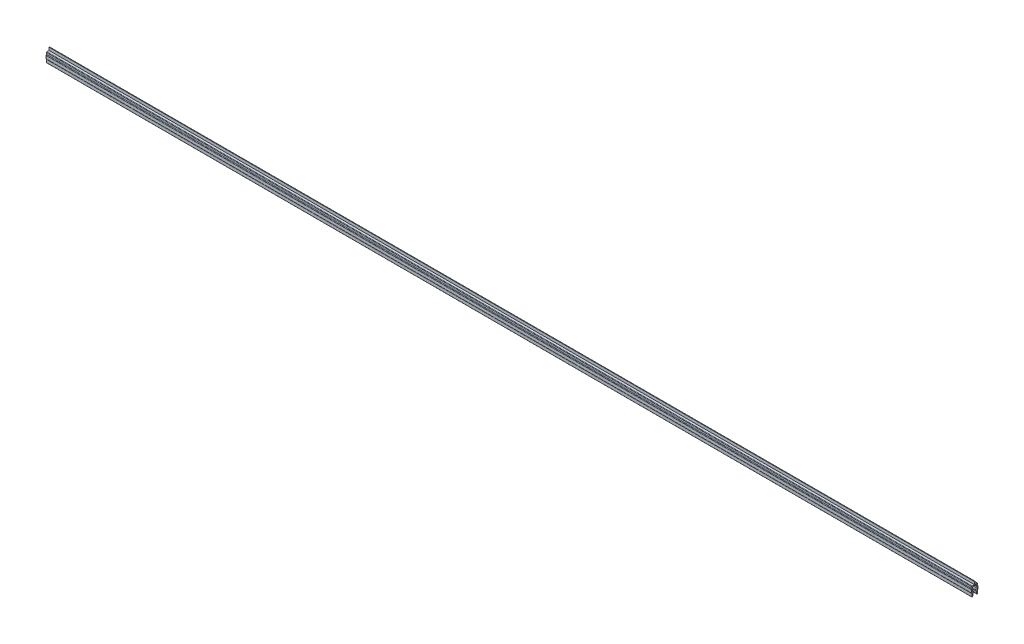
ISO-10303-21;
HEADER;
FILE_DESCRIPTION(('STEP AP214'),'2;1');
FILE_NAME('part.step','',(''),(''),'','','');
FILE_SCHEMA(('AUTOMOTIVE_DESIGN { 1 0 10303 214 1 1 1 1 }'));
ENDSEC;
DATA;
#1=APPLICATION_CONTEXT('core data for automotive mechanical design processes');
#2=APPLICATION_PROTOCOL_DEFINITION('international standard','automotive_design',2000,#1);
#3=PRODUCT_CONTEXT('',#1,'mechanical');
#4=PRODUCT('Part','Part','',(#3));
#5=PRODUCT_RELATED_PRODUCT_CATEGORY('part','',(#4));
#6=PRODUCT_DEFINITION_FORMATION('','',#4);
#7=PRODUCT_DEFINITION_CONTEXT('part definition',#1,'design');
#8=PRODUCT_DEFINITION('design','',#6,#7);
#9=PRODUCT_DEFINITION_SHAPE('','',#8);
#10=(LENGTH_UNIT() NAMED_UNIT(*) SI_UNIT(.MILLI.,.METRE.));
#11=(NAMED_UNIT(*) PLANE_ANGLE_UNIT() SI_UNIT($,.RADIAN.));
#12=(NAMED_UNIT(*) SI_UNIT($,.STERADIAN.) SOLID_ANGLE_UNIT());
#13=UNCERTAINTY_MEASURE_WITH_UNIT(LENGTH_MEASURE(1.E-05),#10,'distance_accuracy_value','');
#14=(GEOMETRIC_REPRESENTATION_CONTEXT(3) GLOBAL_UNCERTAINTY_ASSIGNED_CONTEXT((#13)) GLOBAL_UNIT_ASSIGNED_CONTEXT((#10,
#11,#12)) REPRESENTATION_CONTEXT('',''));
#15=CARTESIAN_POINT('',(0.,0.,0.));
#16=DIRECTION('',(0.,0.,1.));
#17=DIRECTION('',(1.,0.,0.));
#18=AXIS2_PLACEMENT_3D('',#15,#16,#17);
#19=CARTESIAN_POINT('',(1000.,0.,0.3));
#20=DIRECTION('',(0.,-1.,0.));
#21=DIRECTION('',(0.,0.,-1.));
#22=AXIS2_PLACEMENT_3D('',#19,#20,#21);
#23=PLANE('',#22);
#24=DIRECTION('',(0.,0.,1.));
#25=VECTOR('',#24,1.);
#26=CARTESIAN_POINT('',(0.,0.,0.3));
#27=LINE('',#26,#25);
#28=CARTESIAN_POINT('',(0.,0.,0.3));
#29=VERTEX_POINT('',#28);
#30=CARTESIAN_POINT('',(0.,0.,2.61642404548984));
#31=VERTEX_POINT('',#30);
#32=EDGE_CURVE('E383',#29,#31,#27,.T.);
#33=ORIENTED_EDGE('',*,*,#32,.T.);
#34=DIRECTION('',(-1.,0.,0.));
#35=VECTOR('',#34,1.);
#36=CARTESIAN_POINT('',(1000.,0.,2.61642404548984));
#37=LINE('',#36,#35);
#38=CARTESIAN_POINT('',(1000.,0.,2.61642404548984));
#39=VERTEX_POINT('',#38);
#40=EDGE_CURVE('E11',#39,#31,#37,.T.);
#41=ORIENTED_EDGE('',*,*,#40,.F.);
#42=DIRECTION('',(0.,0.,1.));
#43=VECTOR('',#42,1.);
#44=CARTESIAN_POINT('',(1000.,0.,0.3));
#45=LINE('',#44,#43);
#46=CARTESIAN_POINT('',(1000.,0.,0.3));
#47=VERTEX_POINT('',#46);
#48=EDGE_CURVE('E481',#47,#39,#45,.T.);
#49=ORIENTED_EDGE('',*,*,#48,.F.);
#50=DIRECTION('',(-1.,0.,0.));
#51=VECTOR('',#50,1.);
#52=CARTESIAN_POINT('',(1000.,0.,0.3));
#53=LINE('',#52,#51);
#54=EDGE_CURVE('E379',#47,#29,#53,.T.);
#55=ORIENTED_EDGE('',*,*,#54,.T.);
#56=EDGE_LOOP('',(#33,#41,#49,#55));
#57=FACE_BOUND('',#56,.T.);
#58=ADVANCED_FACE('F35',(#57),#23,.F.);
#59=CARTESIAN_POINT('',(1000.,-0.5,2.61642404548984));
#60=DIRECTION('',(-1.,0.,0.));
#61=DIRECTION('',(0.,0.,1.));
#62=AXIS2_PLACEMENT_3D('',#59,#60,#61);
#63=CYLINDRICAL_SURFACE('',#62,0.5);
#64=CARTESIAN_POINT('',(0.,-0.5,2.61642404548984));
#65=DIRECTION('',(1.,0.,0.));
#66=DIRECTION('',(0.,0.,-1.));
#67=AXIS2_PLACEMENT_3D('',#64,#65,#66);
#68=CIRCLE('',#67,0.5);
#69=CARTESIAN_POINT('',(0.,-0.5,3.11642404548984));
#70=VERTEX_POINT('',#69);
#71=EDGE_CURVE('E386',#31,#70,#68,.T.);
#72=ORIENTED_EDGE('',*,*,#71,.T.);
#73=DIRECTION('',(-1.,0.,0.));
#74=VECTOR('',#73,1.);
#75=CARTESIAN_POINT('',(1000.,-0.5,3.11642404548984));
#76=LINE('',#75,#74);
#77=CARTESIAN_POINT('',(1000.,-0.5,3.11642404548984));
#78=VERTEX_POINT('',#77);
#79=EDGE_CURVE('E43',#78,#70,#76,.T.);
#80=ORIENTED_EDGE('',*,*,#79,.F.);
#81=CARTESIAN_POINT('',(1000.,-0.5,2.61642404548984));
#82=DIRECTION('',(1.,0.,0.));
#83=DIRECTION('',(0.,0.,-1.));
#84=AXIS2_PLACEMENT_3D('',#81,#82,#83);
#85=CIRCLE('',#84,0.5);
#86=EDGE_CURVE('E220',#39,#78,#85,.T.);
#87=ORIENTED_EDGE('',*,*,#86,.F.);
#88=ORIENTED_EDGE('',*,*,#40,.T.);
#89=EDGE_LOOP('',(#72,#80,#87,#88));
#90=FACE_BOUND('',#89,.T.);
#91=ADVANCED_FACE('F749',(#90),#63,.T.);
#92=CARTESIAN_POINT('',(1000.,-2.0493903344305,3.11642404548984));
#93=DIRECTION('',(0.,0.,-1.));
#94=DIRECTION('',(-1.,0.,0.));
#95=AXIS2_PLACEMENT_3D('',#92,#93,#94);
#96=PLANE('',#95);
#97=DIRECTION('',(0.,-1.,0.));
#98=VECTOR('',#97,1.);
#99=CARTESIAN_POINT('',(0.,-2.0493903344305,3.11642404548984));
#100=LINE('',#99,#98);
#101=CARTESIAN_POINT('',(0.,-2.0493903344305,3.11642404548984));
#102=VERTEX_POINT('',#101);
#103=EDGE_CURVE('E388',#70,#102,#100,.T.);
#104=ORIENTED_EDGE('',*,*,#103,.T.);
#105=DIRECTION('',(-1.,0.,0.));
#106=VECTOR('',#105,1.);
#107=CARTESIAN_POINT('',(1000.,-2.0493903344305,3.11642404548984));
#108=LINE('',#107,#106);
#109=CARTESIAN_POINT('',(1000.,-2.0493903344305,3.11642404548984));
#110=VERTEX_POINT('',#109);
#111=EDGE_CURVE('E614',#110,#102,#108,.T.);
#112=ORIENTED_EDGE('',*,*,#111,.F.);
#113=DIRECTION('',(0.,-1.,0.));
#114=VECTOR('',#113,1.);
#115=CARTESIAN_POINT('',(1000.,-2.0493903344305,3.11642404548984));
#116=LINE('',#115,#114);
#117=EDGE_CURVE('E622',#78,#110,#116,.T.);
#118=ORIENTED_EDGE('',*,*,#117,.F.);
#119=ORIENTED_EDGE('',*,*,#79,.T.);
#120=EDGE_LOOP('',(#104,#112,#118,#119));
#121=FACE_BOUND('',#120,.T.);
#122=ADVANCED_FACE('F620',(#121),#96,.F.);
#123=CARTESIAN_POINT('',(1000.,-2.0493903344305,3.91642404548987));
#124=DIRECTION('',(-1.,0.,0.));
#125=DIRECTION('',(0.,0.,1.));
#126=AXIS2_PLACEMENT_3D('',#123,#124,#125);
#127=CYLINDRICAL_SURFACE('',#126,0.800000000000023);
#128=CARTESIAN_POINT('',(0.,-2.0493903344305,3.91642404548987));
#129=DIRECTION('',(-1.,0.,0.));
#130=DIRECTION('',(0.,0.,-1.));
#131=AXIS2_PLACEMENT_3D('',#128,#129,#130);
#132=CIRCLE('',#131,0.800000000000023);
#133=CARTESIAN_POINT('',(0.,-2.67997192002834,3.42411635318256));
#134=VERTEX_POINT('',#133);
#135=EDGE_CURVE('E390',#102,#134,#132,.T.);
#136=ORIENTED_EDGE('',*,*,#135,.T.);
#137=DIRECTION('',(-1.,0.,0.));
#138=VECTOR('',#137,1.);
#139=CARTESIAN_POINT('',(1000.,-2.67997192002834,3.42411635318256));
#140=LINE('',#139,#138);
#141=CARTESIAN_POINT('',(1000.,-2.67997192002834,3.42411635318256));
#142=VERTEX_POINT('',#141);
#143=EDGE_CURVE('E611',#142,#134,#140,.T.);
#144=ORIENTED_EDGE('',*,*,#143,.F.);
#145=CARTESIAN_POINT('',(1000.,-2.0493903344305,3.91642404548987));
#146=DIRECTION('',(-1.,0.,0.));
#147=DIRECTION('',(0.,0.,-1.));
#148=AXIS2_PLACEMENT_3D('',#145,#146,#147);
#149=CIRCLE('',#148,0.800000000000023);
#150=EDGE_CURVE('E640',#110,#142,#149,.T.);
#151=ORIENTED_EDGE('',*,*,#150,.F.);
#152=ORIENTED_EDGE('',*,*,#111,.T.);
#153=EDGE_LOOP('',(#136,#144,#151,#152));
#154=FACE_BOUND('',#153,.T.);
#155=ADVANCED_FACE('F631',(#154),#127,.F.);
#156=CARTESIAN_POINT('',(1000.,-3.07408541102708,3.11642404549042));
#157=DIRECTION('',(-1.,0.,0.));
#158=DIRECTION('',(0.,0.,1.));
#159=AXIS2_PLACEMENT_3D('',#156,#157,#158);
#160=CYLINDRICAL_SURFACE('',#159,0.500000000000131);
#161=CARTESIAN_POINT('',(0.,-3.07408541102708,3.11642404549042));
#162=DIRECTION('',(1.,0.,0.));
#163=DIRECTION('',(0.,0.,-1.));
#164=AXIS2_PLACEMENT_3D('',#161,#162,#163);
#165=CIRCLE('',#164,0.500000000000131);
#166=CARTESIAN_POINT('',(0.,-3.07408541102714,3.61642404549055));
#167=VERTEX_POINT('',#166);
#168=EDGE_CURVE('E392',#134,#167,#165,.T.);
#169=ORIENTED_EDGE('',*,*,#168,.T.);
#170=DIRECTION('',(-1.,0.,0.));
#171=VECTOR('',#170,1.);
#172=CARTESIAN_POINT('',(1000.,-3.07408541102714,3.61642404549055));
#173=LINE('',#172,#171);
#174=CARTESIAN_POINT('',(1000.,-3.07408541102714,3.61642404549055));
#175=VERTEX_POINT('',#174);
#176=EDGE_CURVE('E608',#175,#167,#173,.T.);
#177=ORIENTED_EDGE('',*,*,#176,.F.);
#178=CARTESIAN_POINT('',(1000.,-3.07408541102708,3.11642404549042));
#179=DIRECTION('',(1.,0.,0.));
#180=DIRECTION('',(0.,0.,-1.));
#181=AXIS2_PLACEMENT_3D('',#178,#179,#180);
#182=CIRCLE('',#181,0.500000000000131);
#183=EDGE_CURVE('E637',#142,#175,#182,.T.);
#184=ORIENTED_EDGE('',*,*,#183,.F.);
#185=ORIENTED_EDGE('',*,*,#143,.T.);
#186=EDGE_LOOP('',(#169,#177,#184,#185));
#187=FACE_BOUND('',#186,.T.);
#188=ADVANCED_FACE('F635',(#187),#160,.T.);
#189=CARTESIAN_POINT('',(1000.,-5.99663936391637,3.61642404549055));
#190=DIRECTION('',(0.,0.,-1.));
#191=DIRECTION('',(-1.,0.,0.));
#192=AXIS2_PLACEMENT_3D('',#189,#190,#191);
#193=PLANE('',#192);
#194=DIRECTION('',(0.,-1.,0.));
#195=VECTOR('',#194,1.);
#196=CARTESIAN_POINT('',(0.,-5.99663936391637,3.61642404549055));
#197=LINE('',#196,#195);
#198=CARTESIAN_POINT('',(0.,-5.99663936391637,3.61642404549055));
#199=VERTEX_POINT('',#198);
#200=EDGE_CURVE('E394',#167,#199,#197,.T.);
#201=ORIENTED_EDGE('',*,*,#200,.T.);
#202=DIRECTION('',(-1.,0.,0.));
#203=VECTOR('',#202,1.);
#204=CARTESIAN_POINT('',(1000.,-5.99663936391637,3.61642404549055));
#205=LINE('',#204,#203);
#206=CARTESIAN_POINT('',(1000.,-5.99663936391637,3.61642404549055));
#207=VERTEX_POINT('',#206);
#208=EDGE_CURVE('E605',#207,#199,#205,.T.);
#209=ORIENTED_EDGE('',*,*,#208,.F.);
#210=DIRECTION('',(0.,-1.,0.));
#211=VECTOR('',#210,1.);
#212=CARTESIAN_POINT('',(1000.,-5.99663936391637,3.61642404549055));
#213=LINE('',#212,#211);
#214=EDGE_CURVE('E639',#175,#207,#213,.T.);
#215=ORIENTED_EDGE('',*,*,#214,.F.);
#216=ORIENTED_EDGE('',*,*,#176,.T.);
#217=EDGE_LOOP('',(#201,#209,#215,#216));
#218=FACE_BOUND('',#217,.T.);
#219=ADVANCED_FACE('F762',(#218),#193,.F.);
#220=CARTESIAN_POINT('',(1000.,-5.99663936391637,3.11642404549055));
#221=DIRECTION('',(-1.,0.,0.));
#222=DIRECTION('',(0.,0.,1.));
#223=AXIS2_PLACEMENT_3D('',#220,#221,#222);
#224=CYLINDRICAL_SURFACE('',#223,0.499999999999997);
#225=CARTESIAN_POINT('',(0.,-5.99663936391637,3.11642404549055));
#226=DIRECTION('',(1.,0.,0.));
#227=DIRECTION('',(0.,0.,-1.));
#228=AXIS2_PLACEMENT_3D('',#225,#226,#227);
#229=CIRCLE('',#228,0.499999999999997);
#230=CARTESIAN_POINT('',(0.,-6.42965206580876,3.36642404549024));
#231=VERTEX_POINT('',#230);
#232=EDGE_CURVE('E396',#199,#231,#229,.T.);
#233=ORIENTED_EDGE('',*,*,#232,.T.);
#234=DIRECTION('',(-1.,0.,0.));
#235=VECTOR('',#234,1.);
#236=CARTESIAN_POINT('',(1000.,-6.42965206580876,3.36642404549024));
#237=LINE('',#236,#235);
#238=CARTESIAN_POINT('',(1000.,-6.42965206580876,3.36642404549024));
#239=VERTEX_POINT('',#238);
#240=EDGE_CURVE('E602',#239,#231,#237,.T.);
#241=ORIENTED_EDGE('',*,*,#240,.F.);
#242=CARTESIAN_POINT('',(1000.,-5.99663936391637,3.11642404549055));
#243=DIRECTION('',(1.,0.,0.));
#244=DIRECTION('',(0.,0.,-1.));
#245=AXIS2_PLACEMENT_3D('',#242,#243,#244);
#246=CIRCLE('',#245,0.499999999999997);
#247=EDGE_CURVE('E642',#207,#239,#246,.T.);
#248=ORIENTED_EDGE('',*,*,#247,.F.);
#249=ORIENTED_EDGE('',*,*,#208,.T.);
#250=EDGE_LOOP('',(#233,#241,#248,#249));
#251=FACE_BOUND('',#250,.T.);
#252=ADVANCED_FACE('F765',(#251),#224,.T.);
#253=CARTESIAN_POINT('',(1000.,-7.03586984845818,3.71642404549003));
#254=DIRECTION('',(-1.,0.,0.));
#255=DIRECTION('',(0.,0.,1.));
#256=AXIS2_PLACEMENT_3D('',#253,#254,#255);
#257=CYLINDRICAL_SURFACE('',#256,0.700000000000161);
#258=CARTESIAN_POINT('',(0.,-7.03586984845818,3.71642404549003));
#259=DIRECTION('',(-1.,0.,0.));
#260=DIRECTION('',(0.,0.,-1.));
#261=AXIS2_PLACEMENT_3D('',#258,#259,#260);
#262=CIRCLE('',#261,0.700000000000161);
#263=CARTESIAN_POINT('',(0.,-7.03586984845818,3.01642404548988));
#264=VERTEX_POINT('',#263);
#265=EDGE_CURVE('E398',#231,#264,#262,.T.);
#266=ORIENTED_EDGE('',*,*,#265,.T.);
#267=DIRECTION('',(-1.,0.,0.));
#268=VECTOR('',#267,1.);
#269=CARTESIAN_POINT('',(1000.,-7.03586984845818,3.01642404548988));
#270=LINE('',#269,#268);
#271=CARTESIAN_POINT('',(1000.,-7.03586984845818,3.01642404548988));
#272=VERTEX_POINT('',#271);
#273=EDGE_CURVE('E599',#272,#264,#270,.T.);
#274=ORIENTED_EDGE('',*,*,#273,.F.);
#275=CARTESIAN_POINT('',(1000.,-7.03586984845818,3.71642404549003));
#276=DIRECTION('',(-1.,0.,0.));
#277=DIRECTION('',(0.,0.,-1.));
#278=AXIS2_PLACEMENT_3D('',#275,#276,#277);
#279=CIRCLE('',#278,0.700000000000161);
#280=EDGE_CURVE('E648',#239,#272,#279,.T.);
#281=ORIENTED_EDGE('',*,*,#280,.F.);
#282=ORIENTED_EDGE('',*,*,#240,.T.);
#283=EDGE_LOOP('',(#266,#274,#281,#282));
#284=FACE_BOUND('',#283,.T.);
#285=ADVANCED_FACE('F769',(#284),#257,.F.);
#286=CARTESIAN_POINT('',(1000.,-10.0493903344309,3.01642404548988));
#287=DIRECTION('',(0.,0.,-1.));
#288=DIRECTION('',(-1.,0.,0.));
#289=AXIS2_PLACEMENT_3D('',#286,#287,#288);
#290=PLANE('',#289);
#291=DIRECTION('',(0.,-1.,0.));
#292=VECTOR('',#291,1.);
#293=CARTESIAN_POINT('',(0.,-10.0493903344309,3.01642404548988));
#294=LINE('',#293,#292);
#295=CARTESIAN_POINT('',(0.,-10.0493903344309,3.01642404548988));
#296=VERTEX_POINT('',#295);
#297=EDGE_CURVE('E400',#264,#296,#294,.T.);
#298=ORIENTED_EDGE('',*,*,#297,.T.);
#299=DIRECTION('',(-1.,0.,0.));
#300=VECTOR('',#299,1.);
#301=CARTESIAN_POINT('',(1000.,-10.0493903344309,3.01642404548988));
#302=LINE('',#301,#300);
#303=CARTESIAN_POINT('',(1000.,-10.0493903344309,3.01642404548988));
#304=VERTEX_POINT('',#303);
#305=EDGE_CURVE('E596',#304,#296,#302,.T.);
#306=ORIENTED_EDGE('',*,*,#305,.F.);
#307=DIRECTION('',(0.,-1.,0.));
#308=VECTOR('',#307,1.);
#309=CARTESIAN_POINT('',(1000.,-10.0493903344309,3.01642404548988));
#310=LINE('',#309,#308);
#311=EDGE_CURVE('E650',#272,#304,#310,.T.);
#312=ORIENTED_EDGE('',*,*,#311,.F.);
#313=ORIENTED_EDGE('',*,*,#273,.T.);
#314=EDGE_LOOP('',(#298,#306,#312,#313));
#315=FACE_BOUND('',#314,.T.);
#316=ADVANCED_FACE('F773',(#315),#290,.F.);
#317=CARTESIAN_POINT('',(1000.,-10.0493903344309,2.71642404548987));
#318=DIRECTION('',(-1.,0.,0.));
#319=DIRECTION('',(0.,0.,1.));
#320=AXIS2_PLACEMENT_3D('',#317,#318,#319);
#321=CYLINDRICAL_SURFACE('',#320,0.300000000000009);
#322=CARTESIAN_POINT('',(0.,-10.0493903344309,2.71642404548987));
#323=DIRECTION('',(1.,0.,0.));
#324=DIRECTION('',(0.,0.,-1.));
#325=AXIS2_PLACEMENT_3D('',#322,#323,#324);
#326=CIRCLE('',#325,0.300000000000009);
#327=CARTESIAN_POINT('',(0.,-10.3493903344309,2.71642404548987));
#328=VERTEX_POINT('',#327);
#329=EDGE_CURVE('E402',#296,#328,#326,.T.);
#330=ORIENTED_EDGE('',*,*,#329,.T.);
#331=DIRECTION('',(-1.,0.,0.));
#332=VECTOR('',#331,1.);
#333=CARTESIAN_POINT('',(1000.,-10.3493903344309,2.71642404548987));
#334=LINE('',#333,#332);
#335=CARTESIAN_POINT('',(1000.,-10.3493903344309,2.71642404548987));
#336=VERTEX_POINT('',#335);
#337=EDGE_CURVE('E593',#336,#328,#334,.T.);
#338=ORIENTED_EDGE('',*,*,#337,.F.);
#339=CARTESIAN_POINT('',(1000.,-10.0493903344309,2.71642404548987));
#340=DIRECTION('',(1.,0.,0.));
#341=DIRECTION('',(0.,0.,-1.));
#342=AXIS2_PLACEMENT_3D('',#339,#340,#341);
#343=CIRCLE('',#342,0.300000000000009);
#344=EDGE_CURVE('E652',#304,#336,#343,.T.);
#345=ORIENTED_EDGE('',*,*,#344,.F.);
#346=ORIENTED_EDGE('',*,*,#305,.T.);
#347=EDGE_LOOP('',(#330,#338,#345,#346));
#348=FACE_BOUND('',#347,.T.);
#349=ADVANCED_FACE('F777',(#348),#321,.T.);
#350=CARTESIAN_POINT('',(1000.,-10.3493903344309,2.51642404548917));
#351=DIRECTION('',(0.,1.,0.));
#352=DIRECTION('',(0.,0.,1.));
#353=AXIS2_PLACEMENT_3D('',#350,#351,#352);
#354=PLANE('',#353);
#355=DIRECTION('',(0.,0.,-1.));
#356=VECTOR('',#355,1.);
#357=CARTESIAN_POINT('',(0.,-10.3493903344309,2.51642404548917));
#358=LINE('',#357,#356);
#359=CARTESIAN_POINT('',(0.,-10.3493903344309,2.51642404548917));
#360=VERTEX_POINT('',#359);
#361=EDGE_CURVE('E404',#328,#360,#358,.T.);
#362=ORIENTED_EDGE('',*,*,#361,.T.);
#363=DIRECTION('',(-1.,0.,0.));
#364=VECTOR('',#363,1.);
#365=CARTESIAN_POINT('',(1000.,-10.3493903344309,2.51642404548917));
#366=LINE('',#365,#364);
#367=CARTESIAN_POINT('',(1000.,-10.3493903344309,2.51642404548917));
#368=VERTEX_POINT('',#367);
#369=EDGE_CURVE('E590',#368,#360,#366,.T.);
#370=ORIENTED_EDGE('',*,*,#369,.F.);
#371=DIRECTION('',(0.,0.,-1.));
#372=VECTOR('',#371,1.);
#373=CARTESIAN_POINT('',(1000.,-10.3493903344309,2.51642404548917));
#374=LINE('',#373,#372);
#375=EDGE_CURVE('E654',#336,#368,#374,.T.);
#376=ORIENTED_EDGE('',*,*,#375,.F.);
#377=ORIENTED_EDGE('',*,*,#337,.T.);
#378=EDGE_LOOP('',(#362,#370,#376,#377));
#379=FACE_BOUND('',#378,.T.);
#380=ADVANCED_FACE('F781',(#379),#354,.F.);
#381=CARTESIAN_POINT('',(1000.,-9.4833649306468,2.01642404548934));
#382=DIRECTION('',(0.,0.5,0.866025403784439));
#383=DIRECTION('',(0.,-0.866025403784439,0.5));
#384=AXIS2_PLACEMENT_3D('',#381,#382,#383);
#385=PLANE('',#384);
#386=DIRECTION('',(0.,0.866025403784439,-0.5));
#387=VECTOR('',#386,1.);
#388=CARTESIAN_POINT('',(0.,-9.4833649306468,2.01642404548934));
#389=LINE('',#388,#387);
#390=CARTESIAN_POINT('',(0.,-9.4833649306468,2.01642404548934));
#391=VERTEX_POINT('',#390);
#392=EDGE_CURVE('E406',#360,#391,#389,.T.);
#393=ORIENTED_EDGE('',*,*,#392,.T.);
#394=DIRECTION('',(-1.,0.,0.));
#395=VECTOR('',#394,1.);
#396=CARTESIAN_POINT('',(1000.,-9.4833649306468,2.01642404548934));
#397=LINE('',#396,#395);
#398=CARTESIAN_POINT('',(1000.,-9.4833649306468,2.01642404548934));
#399=VERTEX_POINT('',#398);
#400=EDGE_CURVE('E587',#399,#391,#397,.T.);
#401=ORIENTED_EDGE('',*,*,#400,.F.);
#402=DIRECTION('',(0.,0.866025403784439,-0.5));
#403=VECTOR('',#402,1.);
#404=CARTESIAN_POINT('',(1000.,-9.4833649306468,2.01642404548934));
#405=LINE('',#404,#403);
#406=EDGE_CURVE('E656',#368,#399,#405,.T.);
#407=ORIENTED_EDGE('',*,*,#406,.F.);
#408=ORIENTED_EDGE('',*,*,#369,.T.);
#409=EDGE_LOOP('',(#393,#401,#407,#408));
#410=FACE_BOUND('',#409,.T.);
#411=ADVANCED_FACE('F785',(#410),#385,.F.);
#412=CARTESIAN_POINT('',(1000.,-9.4833649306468,2.01642404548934));
#413=DIRECTION('',(0.,0.,1.));
#414=DIRECTION('',(1.,0.,0.));
#415=AXIS2_PLACEMENT_3D('',#412,#413,#414);
#416=PLANE('',#415);
#417=DIRECTION('',(0.,1.,0.));
#418=VECTOR('',#417,1.);
#419=CARTESIAN_POINT('',(0.,-9.4833649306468,2.01642404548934));
#420=LINE('',#419,#418);
#421=CARTESIAN_POINT('',(0.,-7.41548419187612,2.01642404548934));
#422=VERTEX_POINT('',#421);
#423=EDGE_CURVE('E408',#391,#422,#420,.T.);
#424=ORIENTED_EDGE('',*,*,#423,.T.);
#425=DIRECTION('',(-1.,0.,0.));
#426=VECTOR('',#425,1.);
#427=CARTESIAN_POINT('',(1000.,-7.41548419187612,2.01642404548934));
#428=LINE('',#427,#426);
#429=CARTESIAN_POINT('',(1000.,-7.41548419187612,2.01642404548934));
#430=VERTEX_POINT('',#429);
#431=EDGE_CURVE('E584',#430,#422,#428,.T.);
#432=ORIENTED_EDGE('',*,*,#431,.F.);
#433=DIRECTION('',(0.,1.,0.));
#434=VECTOR('',#433,1.);
#435=CARTESIAN_POINT('',(1000.,-9.4833649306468,2.01642404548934));
#436=LINE('',#435,#434);
#437=EDGE_CURVE('E658',#399,#430,#436,.T.);
#438=ORIENTED_EDGE('',*,*,#437,.F.);
#439=ORIENTED_EDGE('',*,*,#400,.T.);
#440=EDGE_LOOP('',(#424,#432,#438,#439));
#441=FACE_BOUND('',#440,.T.);
#442=ADVANCED_FACE('F789',(#441),#416,.F.);
#443=CARTESIAN_POINT('',(1000.,-7.41548419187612,1.51642404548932));
#444=DIRECTION('',(-1.,0.,0.));
#445=DIRECTION('',(0.,0.,1.));
#446=AXIS2_PLACEMENT_3D('',#443,#444,#445);
#447=CYLINDRICAL_SURFACE('',#446,0.500000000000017);
#448=CARTESIAN_POINT('',(0.,-7.41548419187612,1.51642404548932));
#449=DIRECTION('',(-1.,0.,0.));
#450=DIRECTION('',(0.,0.,-1.));
#451=AXIS2_PLACEMENT_3D('',#448,#449,#450);
#452=CIRCLE('',#451,0.500000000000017);
#453=CARTESIAN_POINT('',(0.,-7.03246197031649,1.83781785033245));
#454=VERTEX_POINT('',#453);
#455=EDGE_CURVE('E410',#422,#454,#452,.T.);
#456=ORIENTED_EDGE('',*,*,#455,.T.);
#457=DIRECTION('',(-1.,0.,0.));
#458=VECTOR('',#457,1.);
#459=CARTESIAN_POINT('',(1000.,-7.03246197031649,1.83781785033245));
#460=LINE('',#459,#458);
#461=CARTESIAN_POINT('',(1000.,-7.03246197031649,1.83781785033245));
#462=VERTEX_POINT('',#461);
#463=EDGE_CURVE('E581',#462,#454,#460,.T.);
#464=ORIENTED_EDGE('',*,*,#463,.F.);
#465=CARTESIAN_POINT('',(1000.,-7.41548419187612,1.51642404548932));
#466=DIRECTION('',(-1.,0.,0.));
#467=DIRECTION('',(0.,0.,-1.));
#468=AXIS2_PLACEMENT_3D('',#465,#466,#467);
#469=CIRCLE('',#468,0.500000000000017);
#470=EDGE_CURVE('E660',#430,#462,#469,.T.);
#471=ORIENTED_EDGE('',*,*,#470,.F.);
#472=ORIENTED_EDGE('',*,*,#431,.T.);
#473=EDGE_LOOP('',(#456,#464,#471,#472));
#474=FACE_BOUND('',#473,.T.);
#475=ADVANCED_FACE('F793',(#474),#447,.F.);
#476=CARTESIAN_POINT('',(1000.,-6.24271892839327,0.896638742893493));
#477=DIRECTION('',(0.,0.766044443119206,0.642787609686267));
#478=DIRECTION('',(0.,-0.642787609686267,0.766044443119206));
#479=AXIS2_PLACEMENT_3D('',#476,#477,#478);
#480=PLANE('',#479);
#481=DIRECTION('',(0.,0.642787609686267,-0.766044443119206));
#482=VECTOR('',#481,1.);
#483=CARTESIAN_POINT('',(0.,-6.24271892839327,0.896638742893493));
#484=LINE('',#483,#482);
#485=CARTESIAN_POINT('',(0.,-6.24271892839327,0.896638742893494));
#486=VERTEX_POINT('',#485);
#487=EDGE_CURVE('E412',#454,#486,#484,.T.);
#488=ORIENTED_EDGE('',*,*,#487,.T.);
#489=DIRECTION('',(-1.,0.,0.));
#490=VECTOR('',#489,1.);
#491=CARTESIAN_POINT('',(1000.,-6.24271892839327,0.896638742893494));
#492=LINE('',#491,#490);
#493=CARTESIAN_POINT('',(1000.,-6.24271892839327,0.896638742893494));
#494=VERTEX_POINT('',#493);
#495=EDGE_CURVE('E578',#494,#486,#492,.T.);
#496=ORIENTED_EDGE('',*,*,#495,.F.);
#497=DIRECTION('',(0.,0.642787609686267,-0.766044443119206));
#498=VECTOR('',#497,1.);
#499=CARTESIAN_POINT('',(1000.,-6.24271892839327,0.896638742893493));
#500=LINE('',#499,#498);
#501=EDGE_CURVE('E662',#462,#494,#500,.T.);
#502=ORIENTED_EDGE('',*,*,#501,.F.);
#503=ORIENTED_EDGE('',*,*,#463,.T.);
#504=EDGE_LOOP('',(#488,#496,#502,#503));
#505=FACE_BOUND('',#504,.T.);
#506=ADVANCED_FACE('F797',(#505),#480,.F.);
#507=CARTESIAN_POINT('',(1000.,-6.08951003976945,1.02519626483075));
#508=DIRECTION('',(-1.,0.,0.));
#509=DIRECTION('',(0.,0.,1.));
#510=AXIS2_PLACEMENT_3D('',#507,#508,#509);
#511=CYLINDRICAL_SURFACE('',#510,0.199999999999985);
#512=CARTESIAN_POINT('',(0.,-6.08951003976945,1.02519626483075));
#513=DIRECTION('',(1.,0.,0.));
#514=DIRECTION('',(0.,0.,-1.));
#515=AXIS2_PLACEMENT_3D('',#512,#513,#514);
#516=CIRCLE('',#515,0.199999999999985);
#517=CARTESIAN_POINT('',(0.,-5.88951003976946,1.02519626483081));
#518=VERTEX_POINT('',#517);
#519=EDGE_CURVE('E414',#486,#518,#516,.T.);
#520=ORIENTED_EDGE('',*,*,#519,.T.);
#521=DIRECTION('',(-1.,0.,0.));
#522=VECTOR('',#521,1.);
#523=CARTESIAN_POINT('',(1000.,-5.88951003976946,1.02519626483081));
#524=LINE('',#523,#522);
#525=CARTESIAN_POINT('',(1000.,-5.88951003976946,1.02519626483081));
#526=VERTEX_POINT('',#525);
#527=EDGE_CURVE('E575',#526,#518,#524,.T.);
#528=ORIENTED_EDGE('',*,*,#527,.F.);
#529=CARTESIAN_POINT('',(1000.,-6.08951003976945,1.02519626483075));
#530=DIRECTION('',(1.,0.,0.));
#531=DIRECTION('',(0.,0.,-1.));
#532=AXIS2_PLACEMENT_3D('',#529,#530,#531);
#533=CIRCLE('',#532,0.199999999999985);
#534=EDGE_CURVE('E664',#494,#526,#533,.T.);
#535=ORIENTED_EDGE('',*,*,#534,.F.);
#536=ORIENTED_EDGE('',*,*,#495,.T.);
#537=EDGE_LOOP('',(#520,#528,#535,#536));
#538=FACE_BOUND('',#537,.T.);
#539=ADVANCED_FACE('F801',(#538),#511,.T.);
#540=CARTESIAN_POINT('',(1000.,-5.88951003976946,1.81642404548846));
#541=DIRECTION('',(0.,-1.,0.));
#542=DIRECTION('',(0.,0.,-1.));
#543=AXIS2_PLACEMENT_3D('',#540,#541,#542);
#544=PLANE('',#543);
#545=DIRECTION('',(0.,0.,1.));
#546=VECTOR('',#545,1.);
#547=CARTESIAN_POINT('',(0.,-5.88951003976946,1.81642404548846));
#548=LINE('',#547,#546);
#549=CARTESIAN_POINT('',(0.,-5.88951003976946,1.81642404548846));
#550=VERTEX_POINT('',#549);
#551=EDGE_CURVE('E416',#518,#550,#548,.T.);
#552=ORIENTED_EDGE('',*,*,#551,.T.);
#553=DIRECTION('',(-1.,0.,0.));
#554=VECTOR('',#553,1.);
#555=CARTESIAN_POINT('',(1000.,-5.88951003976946,1.81642404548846));
#556=LINE('',#555,#554);
#557=CARTESIAN_POINT('',(1000.,-5.88951003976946,1.81642404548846));
#558=VERTEX_POINT('',#557);
#559=EDGE_CURVE('E572',#558,#550,#556,.T.);
#560=ORIENTED_EDGE('',*,*,#559,.F.);
#561=DIRECTION('',(0.,0.,1.));
#562=VECTOR('',#561,1.);
#563=CARTESIAN_POINT('',(1000.,-5.88951003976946,1.81642404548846));
#564=LINE('',#563,#562);
#565=EDGE_CURVE('E666',#526,#558,#564,.T.);
#566=ORIENTED_EDGE('',*,*,#565,.F.);
#567=ORIENTED_EDGE('',*,*,#527,.T.);
#568=EDGE_LOOP('',(#552,#560,#566,#567));
#569=FACE_BOUND('',#568,.T.);
#570=ADVANCED_FACE('F805',(#569),#544,.F.);
#571=CARTESIAN_POINT('',(1000.,-5.08951003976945,1.81642404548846));
#572=DIRECTION('',(-1.,0.,0.));
#573=DIRECTION('',(0.,0.,1.));
#574=AXIS2_PLACEMENT_3D('',#571,#572,#573);
#575=CYLINDRICAL_SURFACE('',#574,0.800000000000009);
#576=CARTESIAN_POINT('',(0.,-5.08951003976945,1.81642404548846));
#577=DIRECTION('',(-1.,0.,0.));
#578=DIRECTION('',(0.,0.,-1.));
#579=AXIS2_PLACEMENT_3D('',#576,#577,#578);
#580=CIRCLE('',#579,0.800000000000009);
#581=CARTESIAN_POINT('',(0.,-5.08951003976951,2.61642404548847));
#582=VERTEX_POINT('',#581);
#583=EDGE_CURVE('E418',#550,#582,#580,.T.);
#584=ORIENTED_EDGE('',*,*,#583,.T.);
#585=DIRECTION('',(-1.,0.,0.));
#586=VECTOR('',#585,1.);
#587=CARTESIAN_POINT('',(1000.,-5.08951003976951,2.61642404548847));
#588=LINE('',#587,#586);
#589=CARTESIAN_POINT('',(1000.,-5.08951003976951,2.61642404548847));
#590=VERTEX_POINT('',#589);
#591=EDGE_CURVE('E569',#590,#582,#588,.T.);
#592=ORIENTED_EDGE('',*,*,#591,.F.);
#593=CARTESIAN_POINT('',(1000.,-5.08951003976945,1.81642404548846));
#594=DIRECTION('',(-1.,0.,0.));
#595=DIRECTION('',(0.,0.,-1.));
#596=AXIS2_PLACEMENT_3D('',#593,#594,#595);
#597=CIRCLE('',#596,0.800000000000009);
#598=EDGE_CURVE('E668',#558,#590,#597,.T.);
#599=ORIENTED_EDGE('',*,*,#598,.F.);
#600=ORIENTED_EDGE('',*,*,#559,.T.);
#601=EDGE_LOOP('',(#584,#592,#599,#600));
#602=FACE_BOUND('',#601,.T.);
#603=ADVANCED_FACE('F809',(#602),#575,.F.);
#604=CARTESIAN_POINT('',(1000.,-5.08951003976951,2.61642404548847));
#605=DIRECTION('',(0.,0.,1.));
#606=DIRECTION('',(1.,0.,0.));
#607=AXIS2_PLACEMENT_3D('',#604,#605,#606);
#608=PLANE('',#607);
#609=DIRECTION('',(0.,1.,0.));
#610=VECTOR('',#609,1.);
#611=CARTESIAN_POINT('',(0.,-5.08951003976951,2.61642404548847));
#612=LINE('',#611,#610);
#613=CARTESIAN_POINT('',(0.,-3.63960171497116,2.61642404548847));
#614=VERTEX_POINT('',#613);
#615=EDGE_CURVE('E420',#582,#614,#612,.T.);
#616=ORIENTED_EDGE('',*,*,#615,.T.);
#617=DIRECTION('',(-1.,0.,0.));
#618=VECTOR('',#617,1.);
#619=CARTESIAN_POINT('',(1000.,-3.63960171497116,2.61642404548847));
#620=LINE('',#619,#618);
#621=CARTESIAN_POINT('',(1000.,-3.63960171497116,2.61642404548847));
#622=VERTEX_POINT('',#621);
#623=EDGE_CURVE('E566',#622,#614,#620,.T.);
#624=ORIENTED_EDGE('',*,*,#623,.F.);
#625=DIRECTION('',(0.,1.,0.));
#626=VECTOR('',#625,1.);
#627=CARTESIAN_POINT('',(1000.,-5.08951003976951,2.61642404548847));
#628=LINE('',#627,#626);
#629=EDGE_CURVE('E670',#590,#622,#628,.T.);
#630=ORIENTED_EDGE('',*,*,#629,.F.);
#631=ORIENTED_EDGE('',*,*,#591,.T.);
#632=EDGE_LOOP('',(#616,#624,#630,#631));
#633=FACE_BOUND('',#632,.T.);
#634=ADVANCED_FACE('F813',(#633),#608,.F.);
#635=CARTESIAN_POINT('',(1000.,-3.63960171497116,2.1164240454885));
#636=DIRECTION('',(-1.,0.,0.));
#637=DIRECTION('',(0.,0.,1.));
#638=AXIS2_PLACEMENT_3D('',#635,#636,#637);
#639=CYLINDRICAL_SURFACE('',#638,0.499999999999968);
#640=CARTESIAN_POINT('',(0.,-3.63960171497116,2.1164240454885));
#641=DIRECTION('',(-1.,0.,0.));
#642=DIRECTION('',(0.,0.,-1.));
#643=AXIS2_PLACEMENT_3D('',#640,#641,#642);
#644=CIRCLE('',#643,0.499999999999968);
#645=CARTESIAN_POINT('',(0.,-3.2065890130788,2.36642404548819));
#646=VERTEX_POINT('',#645);
#647=EDGE_CURVE('E422',#614,#646,#644,.T.);
#648=ORIENTED_EDGE('',*,*,#647,.T.);
#649=DIRECTION('',(-1.,0.,0.));
#650=VECTOR('',#649,1.);
#651=CARTESIAN_POINT('',(1000.,-3.2065890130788,2.36642404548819));
#652=LINE('',#651,#650);
#653=CARTESIAN_POINT('',(1000.,-3.2065890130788,2.36642404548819));
#654=VERTEX_POINT('',#653);
#655=EDGE_CURVE('E563',#654,#646,#652,.T.);
#656=ORIENTED_EDGE('',*,*,#655,.F.);
#657=CARTESIAN_POINT('',(1000.,-3.63960171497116,2.1164240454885));
#658=DIRECTION('',(-1.,0.,0.));
#659=DIRECTION('',(0.,0.,-1.));
#660=AXIS2_PLACEMENT_3D('',#657,#658,#659);
#661=CIRCLE('',#660,0.499999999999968);
#662=EDGE_CURVE('E672',#622,#654,#661,.T.);
#663=ORIENTED_EDGE('',*,*,#662,.F.);
#664=ORIENTED_EDGE('',*,*,#623,.T.);
#665=EDGE_LOOP('',(#648,#656,#663,#664));
#666=FACE_BOUND('',#665,.T.);
#667=ADVANCED_FACE('F817',(#666),#639,.F.);
#668=CARTESIAN_POINT('',(1000.,-2.77357631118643,2.61642404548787));
#669=DIRECTION('',(-1.,0.,0.));
#670=DIRECTION('',(0.,0.,1.));
#671=AXIS2_PLACEMENT_3D('',#668,#669,#670);
#672=CYLINDRICAL_SURFACE('',#671,0.49999999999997);
#673=CARTESIAN_POINT('',(0.,-2.77357631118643,2.61642404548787));
#674=DIRECTION('',(1.,0.,0.));
#675=DIRECTION('',(0.,0.,-1.));
#676=AXIS2_PLACEMENT_3D('',#673,#674,#675);
#677=CIRCLE('',#676,0.49999999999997);
#678=CARTESIAN_POINT('',(0.,-2.77357631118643,2.1164240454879));
#679=VERTEX_POINT('',#678);
#680=EDGE_CURVE('E424',#646,#679,#677,.T.);
#681=ORIENTED_EDGE('',*,*,#680,.T.);
#682=DIRECTION('',(-1.,0.,0.));
#683=VECTOR('',#682,1.);
#684=CARTESIAN_POINT('',(1000.,-2.77357631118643,2.1164240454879));
#685=LINE('',#684,#683);
#686=CARTESIAN_POINT('',(1000.,-2.77357631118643,2.1164240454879));
#687=VERTEX_POINT('',#686);
#688=EDGE_CURVE('E560',#687,#679,#685,.T.);
#689=ORIENTED_EDGE('',*,*,#688,.F.);
#690=CARTESIAN_POINT('',(1000.,-2.77357631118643,2.61642404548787));
#691=DIRECTION('',(1.,0.,0.));
#692=DIRECTION('',(0.,0.,-1.));
#693=AXIS2_PLACEMENT_3D('',#690,#691,#692);
#694=CIRCLE('',#693,0.49999999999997);
#695=EDGE_CURVE('E674',#654,#687,#694,.T.);
#696=ORIENTED_EDGE('',*,*,#695,.F.);
#697=ORIENTED_EDGE('',*,*,#655,.T.);
#698=EDGE_LOOP('',(#681,#689,#696,#697));
#699=FACE_BOUND('',#698,.T.);
#700=ADVANCED_FACE('F821',(#699),#672,.T.);
#701=CARTESIAN_POINT('',(1000.,-2.77357631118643,2.1164240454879));
#702=DIRECTION('',(0.,0.,1.));
#703=DIRECTION('',(1.,0.,0.));
#704=AXIS2_PLACEMENT_3D('',#701,#702,#703);
#705=PLANE('',#704);
#706=DIRECTION('',(0.,1.,0.));
#707=VECTOR('',#706,1.);
#708=CARTESIAN_POINT('',(0.,-2.77357631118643,2.1164240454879));
#709=LINE('',#708,#707);
#710=CARTESIAN_POINT('',(0.,-1.50000000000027,2.1164240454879));
#711=VERTEX_POINT('',#710);
#712=EDGE_CURVE('E426',#679,#711,#709,.T.);
#713=ORIENTED_EDGE('',*,*,#712,.T.);
#714=DIRECTION('',(-1.,0.,0.));
#715=VECTOR('',#714,1.);
#716=CARTESIAN_POINT('',(1000.,-1.50000000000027,2.1164240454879));
#717=LINE('',#716,#715);
#718=CARTESIAN_POINT('',(1000.,-1.50000000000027,2.1164240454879));
#719=VERTEX_POINT('',#718);
#720=EDGE_CURVE('E557',#719,#711,#717,.T.);
#721=ORIENTED_EDGE('',*,*,#720,.F.);
#722=DIRECTION('',(0.,1.,0.));
#723=VECTOR('',#722,1.);
#724=CARTESIAN_POINT('',(1000.,-2.77357631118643,2.1164240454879));
#725=LINE('',#724,#723);
#726=EDGE_CURVE('E676',#687,#719,#725,.T.);
#727=ORIENTED_EDGE('',*,*,#726,.F.);
#728=ORIENTED_EDGE('',*,*,#688,.T.);
#729=EDGE_LOOP('',(#713,#721,#727,#728));
#730=FACE_BOUND('',#729,.T.);
#731=ADVANCED_FACE('F825',(#730),#705,.F.);
#732=CARTESIAN_POINT('',(1000.,-1.50000000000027,1.61642404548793));
#733=DIRECTION('',(-1.,0.,0.));
#734=DIRECTION('',(0.,0.,1.));
#735=AXIS2_PLACEMENT_3D('',#732,#733,#734);
#736=CYLINDRICAL_SURFACE('',#735,0.499999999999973);
#737=CARTESIAN_POINT('',(0.,-1.50000000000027,1.61642404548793));
#738=DIRECTION('',(-1.,0.,0.));
#739=DIRECTION('',(0.,0.,-1.));
#740=AXIS2_PLACEMENT_3D('',#737,#738,#739);
#741=CIRCLE('',#740,0.499999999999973);
#742=CARTESIAN_POINT('',(0.,-1.0000000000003,1.61642404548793));
#743=VERTEX_POINT('',#742);
#744=EDGE_CURVE('E428',#711,#743,#741,.T.);
#745=ORIENTED_EDGE('',*,*,#744,.T.);
#746=DIRECTION('',(-1.,0.,0.));
#747=VECTOR('',#746,1.);
#748=CARTESIAN_POINT('',(1000.,-1.0000000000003,1.61642404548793));
#749=LINE('',#748,#747);
#750=CARTESIAN_POINT('',(1000.,-1.0000000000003,1.61642404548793));
#751=VERTEX_POINT('',#750);
#752=EDGE_CURVE('E554',#751,#743,#749,.T.);
#753=ORIENTED_EDGE('',*,*,#752,.F.);
#754=CARTESIAN_POINT('',(1000.,-1.50000000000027,1.61642404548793));
#755=DIRECTION('',(-1.,0.,0.));
#756=DIRECTION('',(0.,0.,-1.));
#757=AXIS2_PLACEMENT_3D('',#754,#755,#756);
#758=CIRCLE('',#757,0.499999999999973);
#759=EDGE_CURVE('E678',#719,#751,#758,.T.);
#760=ORIENTED_EDGE('',*,*,#759,.F.);
#761=ORIENTED_EDGE('',*,*,#720,.T.);
#762=EDGE_LOOP('',(#745,#753,#760,#761));
#763=FACE_BOUND('',#762,.T.);
#764=ADVANCED_FACE('F829',(#763),#736,.F.);
#765=CARTESIAN_POINT('',(1000.,-1.0000000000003,-1.61642404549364));
#766=DIRECTION('',(0.,1.,0.));
#767=DIRECTION('',(0.,0.,1.));
#768=AXIS2_PLACEMENT_3D('',#765,#766,#767);
#769=PLANE('',#768);
#770=DIRECTION('',(0.,0.,-1.));
#771=VECTOR('',#770,1.);
#772=CARTESIAN_POINT('',(0.,-1.0000000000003,-1.61642404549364));
#773=LINE('',#772,#771);
#774=CARTESIAN_POINT('',(0.,-1.0000000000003,-1.61642404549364));
#775=VERTEX_POINT('',#774);
#776=EDGE_CURVE('E430',#743,#775,#773,.T.);
#777=ORIENTED_EDGE('',*,*,#776,.T.);
#778=DIRECTION('',(-1.,0.,0.));
#779=VECTOR('',#778,1.);
#780=CARTESIAN_POINT('',(1000.,-1.0000000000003,-1.61642404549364));
#781=LINE('',#780,#779);
#782=CARTESIAN_POINT('',(1000.,-1.0000000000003,-1.61642404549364));
#783=VERTEX_POINT('',#782);
#784=EDGE_CURVE('E551',#783,#775,#781,.T.);
#785=ORIENTED_EDGE('',*,*,#784,.F.);
#786=DIRECTION('',(0.,0.,-1.));
#787=VECTOR('',#786,1.);
#788=CARTESIAN_POINT('',(1000.,-1.0000000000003,-1.61642404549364));
#789=LINE('',#788,#787);
#790=EDGE_CURVE('E680',#751,#783,#789,.T.);
#791=ORIENTED_EDGE('',*,*,#790,.F.);
#792=ORIENTED_EDGE('',*,*,#752,.T.);
#793=EDGE_LOOP('',(#777,#785,#791,#792));
#794=FACE_BOUND('',#793,.T.);
#795=ADVANCED_FACE('F833',(#794),#769,.F.);
#796=CARTESIAN_POINT('',(1000.,-1.50000000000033,-1.61642404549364));
#797=DIRECTION('',(-1.,0.,0.));
#798=DIRECTION('',(0.,0.,1.));
#799=AXIS2_PLACEMENT_3D('',#796,#797,#798);
#800=CYLINDRICAL_SURFACE('',#799,0.500000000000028);
#801=CARTESIAN_POINT('',(0.,-1.50000000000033,-1.61642404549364));
#802=DIRECTION('',(-1.,0.,0.));
#803=DIRECTION('',(0.,0.,-1.));
#804=AXIS2_PLACEMENT_3D('',#801,#802,#803);
#805=CIRCLE('',#804,0.500000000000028);
#806=CARTESIAN_POINT('',(0.,-1.50000000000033,-2.11642404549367));
#807=VERTEX_POINT('',#806);
#808=EDGE_CURVE('E432',#775,#807,#805,.T.);
#809=ORIENTED_EDGE('',*,*,#808,.T.);
#810=DIRECTION('',(-1.,0.,0.));
#811=VECTOR('',#810,1.);
#812=CARTESIAN_POINT('',(1000.,-1.50000000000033,-2.11642404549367));
#813=LINE('',#812,#811);
#814=CARTESIAN_POINT('',(1000.,-1.50000000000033,-2.11642404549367));
#815=VERTEX_POINT('',#814);
#816=EDGE_CURVE('E548',#815,#807,#813,.T.);
#817=ORIENTED_EDGE('',*,*,#816,.F.);
#818=CARTESIAN_POINT('',(1000.,-1.50000000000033,-1.61642404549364));
#819=DIRECTION('',(-1.,0.,0.));
#820=DIRECTION('',(0.,0.,-1.));
#821=AXIS2_PLACEMENT_3D('',#818,#819,#820);
#822=CIRCLE('',#821,0.500000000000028);
#823=EDGE_CURVE('E682',#783,#815,#822,.T.);
#824=ORIENTED_EDGE('',*,*,#823,.F.);
#825=ORIENTED_EDGE('',*,*,#784,.T.);
#826=EDGE_LOOP('',(#809,#817,#824,#825));
#827=FACE_BOUND('',#826,.T.);
#828=ADVANCED_FACE('F837',(#827),#800,.F.);
#829=CARTESIAN_POINT('',(1000.,-2.77357631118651,-2.11642404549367));
#830=DIRECTION('',(0.,0.,-1.));
#831=DIRECTION('',(-1.,0.,0.));
#832=AXIS2_PLACEMENT_3D('',#829,#830,#831);
#833=PLANE('',#832);
#834=DIRECTION('',(0.,-1.,0.));
#835=VECTOR('',#834,1.);
#836=CARTESIAN_POINT('',(0.,-2.77357631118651,-2.11642404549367));
#837=LINE('',#836,#835);
#838=CARTESIAN_POINT('',(0.,-2.77357631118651,-2.11642404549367));
#839=VERTEX_POINT('',#838);
#840=EDGE_CURVE('E434',#807,#839,#837,.T.);
#841=ORIENTED_EDGE('',*,*,#840,.T.);
#842=DIRECTION('',(-1.,0.,0.));
#843=VECTOR('',#842,1.);
#844=CARTESIAN_POINT('',(1000.,-2.77357631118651,-2.11642404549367));
#845=LINE('',#844,#843);
#846=CARTESIAN_POINT('',(1000.,-2.77357631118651,-2.11642404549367));
#847=VERTEX_POINT('',#846);
#848=EDGE_CURVE('E545',#847,#839,#845,.T.);
#849=ORIENTED_EDGE('',*,*,#848,.F.);
#850=DIRECTION('',(0.,-1.,0.));
#851=VECTOR('',#850,1.);
#852=CARTESIAN_POINT('',(1000.,-2.77357631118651,-2.11642404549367));
#853=LINE('',#852,#851);
#854=EDGE_CURVE('E684',#815,#847,#853,.T.);
#855=ORIENTED_EDGE('',*,*,#854,.F.);
#856=ORIENTED_EDGE('',*,*,#816,.T.);
#857=EDGE_LOOP('',(#841,#849,#855,#856));
#858=FACE_BOUND('',#857,.T.);
#859=ADVANCED_FACE('F841',(#858),#833,.F.);
#860=CARTESIAN_POINT('',(1000.,-2.77357631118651,-2.6164240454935));
#861=DIRECTION('',(-1.,0.,0.));
#862=DIRECTION('',(0.,0.,1.));
#863=AXIS2_PLACEMENT_3D('',#860,#861,#862);
#864=CYLINDRICAL_SURFACE('',#863,0.499999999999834);
#865=CARTESIAN_POINT('',(0.,-2.77357631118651,-2.6164240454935));
#866=DIRECTION('',(1.,0.,0.));
#867=DIRECTION('',(0.,0.,-1.));
#868=AXIS2_PLACEMENT_3D('',#865,#866,#867);
#869=CIRCLE('',#868,0.499999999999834);
#870=CARTESIAN_POINT('',(0.,-3.20658901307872,-2.36642404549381));
#871=VERTEX_POINT('',#870);
#872=EDGE_CURVE('E436',#839,#871,#869,.T.);
#873=ORIENTED_EDGE('',*,*,#872,.T.);
#874=DIRECTION('',(-1.,0.,0.));
#875=VECTOR('',#874,1.);
#876=CARTESIAN_POINT('',(1000.,-3.20658901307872,-2.36642404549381));
#877=LINE('',#876,#875);
#878=CARTESIAN_POINT('',(1000.,-3.20658901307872,-2.36642404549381));
#879=VERTEX_POINT('',#878);
#880=EDGE_CURVE('E542',#879,#871,#877,.T.);
#881=ORIENTED_EDGE('',*,*,#880,.F.);
#882=CARTESIAN_POINT('',(1000.,-2.77357631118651,-2.6164240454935));
#883=DIRECTION('',(1.,0.,0.));
#884=DIRECTION('',(0.,0.,-1.));
#885=AXIS2_PLACEMENT_3D('',#882,#883,#884);
#886=CIRCLE('',#885,0.499999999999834);
#887=EDGE_CURVE('E686',#847,#879,#886,.T.);
#888=ORIENTED_EDGE('',*,*,#887,.F.);
#889=ORIENTED_EDGE('',*,*,#848,.T.);
#890=EDGE_LOOP('',(#873,#881,#888,#889));
#891=FACE_BOUND('',#890,.T.);
#892=ADVANCED_FACE('F845',(#891),#864,.T.);
#893=CARTESIAN_POINT('',(1000.,-3.6396017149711,-2.11642404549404));
#894=DIRECTION('',(-1.,0.,0.));
#895=DIRECTION('',(0.,0.,1.));
#896=AXIS2_PLACEMENT_3D('',#893,#894,#895);
#897=CYLINDRICAL_SURFACE('',#896,0.500000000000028);
#898=CARTESIAN_POINT('',(0.,-3.6396017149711,-2.11642404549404));
#899=DIRECTION('',(-1.,0.,0.));
#900=DIRECTION('',(0.,0.,-1.));
#901=AXIS2_PLACEMENT_3D('',#898,#899,#900);
#902=CIRCLE('',#901,0.500000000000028);
#903=CARTESIAN_POINT('',(0.,-3.6396017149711,-2.61642404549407));
#904=VERTEX_POINT('',#903);
#905=EDGE_CURVE('E438',#871,#904,#902,.T.);
#906=ORIENTED_EDGE('',*,*,#905,.T.);
#907=DIRECTION('',(-1.,0.,0.));
#908=VECTOR('',#907,1.);
#909=CARTESIAN_POINT('',(1000.,-3.6396017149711,-2.61642404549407));
#910=LINE('',#909,#908);
#911=CARTESIAN_POINT('',(1000.,-3.6396017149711,-2.61642404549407));
#912=VERTEX_POINT('',#911);
#913=EDGE_CURVE('E539',#912,#904,#910,.T.);
#914=ORIENTED_EDGE('',*,*,#913,.F.);
#915=CARTESIAN_POINT('',(1000.,-3.6396017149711,-2.11642404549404));
#916=DIRECTION('',(-1.,0.,0.));
#917=DIRECTION('',(0.,0.,-1.));
#918=AXIS2_PLACEMENT_3D('',#915,#916,#917);
#919=CIRCLE('',#918,0.500000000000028);
#920=EDGE_CURVE('E688',#879,#912,#919,.T.);
#921=ORIENTED_EDGE('',*,*,#920,.F.);
#922=ORIENTED_EDGE('',*,*,#880,.T.);
#923=EDGE_LOOP('',(#906,#914,#921,#922));
#924=FACE_BOUND('',#923,.T.);
#925=ADVANCED_FACE('F849',(#924),#897,.F.);
#926=CARTESIAN_POINT('',(1000.,-5.08951003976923,-2.61642404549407));
#927=DIRECTION('',(0.,0.,-1.));
#928=DIRECTION('',(-1.,0.,0.));
#929=AXIS2_PLACEMENT_3D('',#926,#927,#928);
#930=PLANE('',#929);
#931=DIRECTION('',(0.,-1.,0.));
#932=VECTOR('',#931,1.);
#933=CARTESIAN_POINT('',(0.,-5.08951003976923,-2.61642404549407));
#934=LINE('',#933,#932);
#935=CARTESIAN_POINT('',(0.,-5.08951003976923,-2.61642404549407));
#936=VERTEX_POINT('',#935);
#937=EDGE_CURVE('E440',#904,#936,#934,.T.);
#938=ORIENTED_EDGE('',*,*,#937,.T.);
#939=DIRECTION('',(-1.,0.,0.));
#940=VECTOR('',#939,1.);
#941=CARTESIAN_POINT('',(1000.,-5.08951003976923,-2.61642404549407));
#942=LINE('',#941,#940);
#943=CARTESIAN_POINT('',(1000.,-5.08951003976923,-2.61642404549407));
#944=VERTEX_POINT('',#943);
#945=EDGE_CURVE('E536',#944,#936,#942,.T.);
#946=ORIENTED_EDGE('',*,*,#945,.F.);
#947=DIRECTION('',(0.,-1.,0.));
#948=VECTOR('',#947,1.);
#949=CARTESIAN_POINT('',(1000.,-5.08951003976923,-2.61642404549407));
#950=LINE('',#949,#948);
#951=EDGE_CURVE('E690',#912,#944,#950,.T.);
#952=ORIENTED_EDGE('',*,*,#951,.F.);
#953=ORIENTED_EDGE('',*,*,#913,.T.);
#954=EDGE_LOOP('',(#938,#946,#952,#953));
#955=FACE_BOUND('',#954,.T.);
#956=ADVANCED_FACE('F853',(#955),#930,.F.);
#957=CARTESIAN_POINT('',(1000.,-5.08951003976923,-1.81642404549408));
#958=DIRECTION('',(-1.,0.,0.));
#959=DIRECTION('',(0.,0.,1.));
#960=AXIS2_PLACEMENT_3D('',#957,#958,#959);
#961=CYLINDRICAL_SURFACE('',#960,0.799999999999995);
#962=CARTESIAN_POINT('',(0.,-5.08951003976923,-1.81642404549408));
#963=DIRECTION('',(-1.,0.,0.));
#964=DIRECTION('',(0.,0.,-1.));
#965=AXIS2_PLACEMENT_3D('',#962,#963,#964);
#966=CIRCLE('',#965,0.799999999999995);
#967=CARTESIAN_POINT('',(0.,-5.88951003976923,-1.81642404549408));
#968=VERTEX_POINT('',#967);
#969=EDGE_CURVE('E442',#936,#968,#966,.T.);
#970=ORIENTED_EDGE('',*,*,#969,.T.);
#971=DIRECTION('',(-1.,0.,0.));
#972=VECTOR('',#971,1.);
#973=CARTESIAN_POINT('',(1000.,-5.88951003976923,-1.81642404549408));
#974=LINE('',#973,#972);
#975=CARTESIAN_POINT('',(1000.,-5.88951003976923,-1.81642404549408));
#976=VERTEX_POINT('',#975);
#977=EDGE_CURVE('E533',#976,#968,#974,.T.);
#978=ORIENTED_EDGE('',*,*,#977,.F.);
#979=CARTESIAN_POINT('',(1000.,-5.08951003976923,-1.81642404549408));
#980=DIRECTION('',(-1.,0.,0.));
#981=DIRECTION('',(0.,0.,-1.));
#982=AXIS2_PLACEMENT_3D('',#979,#980,#981);
#983=CIRCLE('',#982,0.799999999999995);
#984=EDGE_CURVE('E692',#944,#976,#983,.T.);
#985=ORIENTED_EDGE('',*,*,#984,.F.);
#986=ORIENTED_EDGE('',*,*,#945,.T.);
#987=EDGE_LOOP('',(#970,#978,#985,#986));
#988=FACE_BOUND('',#987,.T.);
#989=ADVANCED_FACE('F857',(#988),#961,.F.);
#990=CARTESIAN_POINT('',(1000.,-5.88951003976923,-1.81642404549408));
#991=DIRECTION('',(0.,-1.,0.));
#992=DIRECTION('',(0.,0.,-1.));
#993=AXIS2_PLACEMENT_3D('',#990,#991,#992);
#994=PLANE('',#993);
#995=DIRECTION('',(0.,0.,1.));
#996=VECTOR('',#995,1.);
#997=CARTESIAN_POINT('',(0.,-5.88951003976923,-1.81642404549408));
#998=LINE('',#997,#996);
#999=CARTESIAN_POINT('',(0.,-5.88951003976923,-1.02519626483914));
#1000=VERTEX_POINT('',#999);
#1001=EDGE_CURVE('E444',#968,#1000,#998,.T.);
#1002=ORIENTED_EDGE('',*,*,#1001,.T.);
#1003=DIRECTION('',(-1.,0.,0.));
#1004=VECTOR('',#1003,1.);
#1005=CARTESIAN_POINT('',(1000.,-5.88951003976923,-1.02519626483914));
#1006=LINE('',#1005,#1004);
#1007=CARTESIAN_POINT('',(1000.,-5.88951003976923,-1.02519626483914));
#1008=VERTEX_POINT('',#1007);
#1009=EDGE_CURVE('E530',#1008,#1000,#1006,.T.);
#1010=ORIENTED_EDGE('',*,*,#1009,.F.);
#1011=DIRECTION('',(0.,0.,1.));
#1012=VECTOR('',#1011,1.);
#1013=CARTESIAN_POINT('',(1000.,-5.88951003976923,-1.81642404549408));
#1014=LINE('',#1013,#1012);
#1015=EDGE_CURVE('E694',#976,#1008,#1014,.T.);
#1016=ORIENTED_EDGE('',*,*,#1015,.F.);
#1017=ORIENTED_EDGE('',*,*,#977,.T.);
#1018=EDGE_LOOP('',(#1002,#1010,#1016,#1017));
#1019=FACE_BOUND('',#1018,.T.);
#1020=ADVANCED_FACE('F861',(#1019),#994,.F.);
#1021=CARTESIAN_POINT('',(1000.,-6.08951003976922,-1.02519626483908));
#1022=DIRECTION('',(-1.,0.,0.));
#1023=DIRECTION('',(0.,0.,1.));
#1024=AXIS2_PLACEMENT_3D('',#1021,#1022,#1023);
#1025=CYLINDRICAL_SURFACE('',#1024,0.199999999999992);
#1026=CARTESIAN_POINT('',(0.,-6.08951003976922,-1.02519626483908));
#1027=DIRECTION('',(1.,0.,0.));
#1028=DIRECTION('',(0.,0.,-1.));
#1029=AXIS2_PLACEMENT_3D('',#1026,#1027,#1028);
#1030=CIRCLE('',#1029,0.199999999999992);
#1031=CARTESIAN_POINT('',(0.,-6.24271892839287,-0.896638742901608));
#1032=VERTEX_POINT('',#1031);
#1033=EDGE_CURVE('E446',#1000,#1032,#1030,.T.);
#1034=ORIENTED_EDGE('',*,*,#1033,.T.);
#1035=DIRECTION('',(-1.,0.,0.));
#1036=VECTOR('',#1035,1.);
#1037=CARTESIAN_POINT('',(1000.,-6.24271892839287,-0.896638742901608));
#1038=LINE('',#1037,#1036);
#1039=CARTESIAN_POINT('',(1000.,-6.24271892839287,-0.896638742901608));
#1040=VERTEX_POINT('',#1039);
#1041=EDGE_CURVE('E527',#1040,#1032,#1038,.T.);
#1042=ORIENTED_EDGE('',*,*,#1041,.F.);
#1043=CARTESIAN_POINT('',(1000.,-6.08951003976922,-1.02519626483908));
#1044=DIRECTION('',(1.,0.,0.));
#1045=DIRECTION('',(0.,0.,-1.));
#1046=AXIS2_PLACEMENT_3D('',#1043,#1044,#1045);
#1047=CIRCLE('',#1046,0.199999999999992);
#1048=EDGE_CURVE('E696',#1008,#1040,#1047,.T.);
#1049=ORIENTED_EDGE('',*,*,#1048,.F.);
#1050=ORIENTED_EDGE('',*,*,#1009,.T.);
#1051=EDGE_LOOP('',(#1034,#1042,#1049,#1050));
#1052=FACE_BOUND('',#1051,.T.);
#1053=ADVANCED_FACE('F865',(#1052),#1025,.T.);
#1054=CARTESIAN_POINT('',(1000.,-6.24271892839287,-0.896638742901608));
#1055=DIRECTION('',(0.,0.766044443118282,-0.642787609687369));
#1056=DIRECTION('',(0.,0.642787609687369,0.766044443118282));
#1057=AXIS2_PLACEMENT_3D('',#1054,#1055,#1056);
#1058=PLANE('',#1057);
#1059=DIRECTION('',(0.,-0.642787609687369,-0.766044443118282));
#1060=VECTOR('',#1059,1.);
#1061=CARTESIAN_POINT('',(0.,-6.24271892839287,-0.896638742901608));
#1062=LINE('',#1061,#1060);
#1063=CARTESIAN_POINT('',(0.,-7.03246197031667,-1.83781785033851));
#1064=VERTEX_POINT('',#1063);
#1065=EDGE_CURVE('E448',#1032,#1064,#1062,.T.);
#1066=ORIENTED_EDGE('',*,*,#1065,.T.);
#1067=DIRECTION('',(-1.,0.,0.));
#1068=VECTOR('',#1067,1.);
#1069=CARTESIAN_POINT('',(1000.,-7.03246197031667,-1.83781785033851));
#1070=LINE('',#1069,#1068);
#1071=CARTESIAN_POINT('',(1000.,-7.03246197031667,-1.83781785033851));
#1072=VERTEX_POINT('',#1071);
#1073=EDGE_CURVE('E524',#1072,#1064,#1070,.T.);
#1074=ORIENTED_EDGE('',*,*,#1073,.F.);
#1075=DIRECTION('',(0.,-0.642787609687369,-0.766044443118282));
#1076=VECTOR('',#1075,1.);
#1077=CARTESIAN_POINT('',(1000.,-6.24271892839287,-0.896638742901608));
#1078=LINE('',#1077,#1076);
#1079=EDGE_CURVE('E698',#1040,#1072,#1078,.T.);
#1080=ORIENTED_EDGE('',*,*,#1079,.F.);
#1081=ORIENTED_EDGE('',*,*,#1041,.T.);
#1082=EDGE_LOOP('',(#1066,#1074,#1080,#1081));
#1083=FACE_BOUND('',#1082,.T.);
#1084=ADVANCED_FACE('F869',(#1083),#1058,.F.);
#1085=CARTESIAN_POINT('',(1000.,-7.41548419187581,-1.51642404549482));
#1086=DIRECTION('',(-1.,0.,0.));
#1087=DIRECTION('',(0.,0.,1.));
#1088=AXIS2_PLACEMENT_3D('',#1085,#1086,#1087);
#1089=CYLINDRICAL_SURFACE('',#1088,0.500000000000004);
#1090=CARTESIAN_POINT('',(0.,-7.41548419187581,-1.51642404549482));
#1091=DIRECTION('',(-1.,0.,0.));
#1092=DIRECTION('',(0.,0.,-1.));
#1093=AXIS2_PLACEMENT_3D('',#1090,#1091,#1092);
#1094=CIRCLE('',#1093,0.500000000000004);
#1095=CARTESIAN_POINT('',(0.,-7.41548419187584,-2.01642404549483));
#1096=VERTEX_POINT('',#1095);
#1097=EDGE_CURVE('E450',#1064,#1096,#1094,.T.);
#1098=ORIENTED_EDGE('',*,*,#1097,.T.);
#1099=DIRECTION('',(-1.,0.,0.));
#1100=VECTOR('',#1099,1.);
#1101=CARTESIAN_POINT('',(1000.,-7.41548419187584,-2.01642404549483));
#1102=LINE('',#1101,#1100);
#1103=CARTESIAN_POINT('',(1000.,-7.41548419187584,-2.01642404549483));
#1104=VERTEX_POINT('',#1103);
#1105=EDGE_CURVE('E521',#1104,#1096,#1102,.T.);
#1106=ORIENTED_EDGE('',*,*,#1105,.F.);
#1107=CARTESIAN_POINT('',(1000.,-7.41548419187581,-1.51642404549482));
#1108=DIRECTION('',(-1.,0.,0.));
#1109=DIRECTION('',(0.,0.,-1.));
#1110=AXIS2_PLACEMENT_3D('',#1107,#1108,#1109);
#1111=CIRCLE('',#1110,0.500000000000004);
#1112=EDGE_CURVE('E700',#1072,#1104,#1111,.T.);
#1113=ORIENTED_EDGE('',*,*,#1112,.F.);
#1114=ORIENTED_EDGE('',*,*,#1073,.T.);
#1115=EDGE_LOOP('',(#1098,#1106,#1113,#1114));
#1116=FACE_BOUND('',#1115,.T.);
#1117=ADVANCED_FACE('F873',(#1116),#1089,.F.);
#1118=CARTESIAN_POINT('',(1000.,-9.4833649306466,-2.01642404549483));
#1119=DIRECTION('',(0.,0.,-1.));
#1120=DIRECTION('',(-1.,0.,0.));
#1121=AXIS2_PLACEMENT_3D('',#1118,#1119,#1120);
#1122=PLANE('',#1121);
#1123=DIRECTION('',(0.,-1.,0.));
#1124=VECTOR('',#1123,1.);
#1125=CARTESIAN_POINT('',(0.,-9.4833649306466,-2.01642404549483));
#1126=LINE('',#1125,#1124);
#1127=CARTESIAN_POINT('',(0.,-9.4833649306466,-2.01642404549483));
#1128=VERTEX_POINT('',#1127);
#1129=EDGE_CURVE('E452',#1096,#1128,#1126,.T.);
#1130=ORIENTED_EDGE('',*,*,#1129,.T.);
#1131=DIRECTION('',(-1.,0.,0.));
#1132=VECTOR('',#1131,1.);
#1133=CARTESIAN_POINT('',(1000.,-9.4833649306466,-2.01642404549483));
#1134=LINE('',#1133,#1132);
#1135=CARTESIAN_POINT('',(1000.,-9.4833649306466,-2.01642404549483));
#1136=VERTEX_POINT('',#1135);
#1137=EDGE_CURVE('E518',#1136,#1128,#1134,.T.);
#1138=ORIENTED_EDGE('',*,*,#1137,.F.);
#1139=DIRECTION('',(0.,-1.,0.));
#1140=VECTOR('',#1139,1.);
#1141=CARTESIAN_POINT('',(1000.,-9.4833649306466,-2.01642404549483));
#1142=LINE('',#1141,#1140);
#1143=EDGE_CURVE('E702',#1104,#1136,#1142,.T.);
#1144=ORIENTED_EDGE('',*,*,#1143,.F.);
#1145=ORIENTED_EDGE('',*,*,#1105,.T.);
#1146=EDGE_LOOP('',(#1130,#1138,#1144,#1145));
#1147=FACE_BOUND('',#1146,.T.);
#1148=ADVANCED_FACE('F877',(#1147),#1122,.F.);
#1149=CARTESIAN_POINT('',(1000.,-9.4833649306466,-2.01642404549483));
#1150=DIRECTION('',(0.,0.5,-0.866025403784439));
#1151=DIRECTION('',(0.,0.866025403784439,0.5));
#1152=AXIS2_PLACEMENT_3D('',#1149,#1150,#1151);
#1153=PLANE('',#1152);
#1154=DIRECTION('',(0.,-0.866025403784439,-0.5));
#1155=VECTOR('',#1154,1.);
#1156=CARTESIAN_POINT('',(0.,-9.4833649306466,-2.01642404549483));
#1157=LINE('',#1156,#1155);
#1158=CARTESIAN_POINT('',(0.,-10.3493903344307,-2.51642404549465));
#1159=VERTEX_POINT('',#1158);
#1160=EDGE_CURVE('E454',#1128,#1159,#1157,.T.);
#1161=ORIENTED_EDGE('',*,*,#1160,.T.);
#1162=DIRECTION('',(-1.,0.,0.));
#1163=VECTOR('',#1162,1.);
#1164=CARTESIAN_POINT('',(1000.,-10.3493903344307,-2.51642404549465));
#1165=LINE('',#1164,#1163);
#1166=CARTESIAN_POINT('',(1000.,-10.3493903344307,-2.51642404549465));
#1167=VERTEX_POINT('',#1166);
#1168=EDGE_CURVE('E515',#1167,#1159,#1165,.T.);
#1169=ORIENTED_EDGE('',*,*,#1168,.F.);
#1170=DIRECTION('',(0.,-0.866025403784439,-0.5));
#1171=VECTOR('',#1170,1.);
#1172=CARTESIAN_POINT('',(1000.,-9.4833649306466,-2.01642404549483));
#1173=LINE('',#1172,#1171);
#1174=EDGE_CURVE('E704',#1136,#1167,#1173,.T.);
#1175=ORIENTED_EDGE('',*,*,#1174,.F.);
#1176=ORIENTED_EDGE('',*,*,#1137,.T.);
#1177=EDGE_LOOP('',(#1161,#1169,#1175,#1176));
#1178=FACE_BOUND('',#1177,.T.);
#1179=ADVANCED_FACE('F881',(#1178),#1153,.F.);
#1180=CARTESIAN_POINT('',(1000.,-10.3493903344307,-2.51642404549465));
#1181=DIRECTION('',(0.,1.,0.));
#1182=DIRECTION('',(0.,0.,1.));
#1183=AXIS2_PLACEMENT_3D('',#1180,#1181,#1182);
#1184=PLANE('',#1183);
#1185=DIRECTION('',(0.,0.,-1.));
#1186=VECTOR('',#1185,1.);
#1187=CARTESIAN_POINT('',(0.,-10.3493903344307,-2.51642404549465));
#1188=LINE('',#1187,#1186);
#1189=CARTESIAN_POINT('',(0.,-10.3493903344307,-2.71642404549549));
#1190=VERTEX_POINT('',#1189);
#1191=EDGE_CURVE('E456',#1159,#1190,#1188,.T.);
#1192=ORIENTED_EDGE('',*,*,#1191,.T.);
#1193=DIRECTION('',(-1.,0.,0.));
#1194=VECTOR('',#1193,1.);
#1195=CARTESIAN_POINT('',(1000.,-10.3493903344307,-2.71642404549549));
#1196=LINE('',#1195,#1194);
#1197=CARTESIAN_POINT('',(1000.,-10.3493903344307,-2.71642404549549));
#1198=VERTEX_POINT('',#1197);
#1199=EDGE_CURVE('E512',#1198,#1190,#1196,.T.);
#1200=ORIENTED_EDGE('',*,*,#1199,.F.);
#1201=DIRECTION('',(0.,0.,-1.));
#1202=VECTOR('',#1201,1.);
#1203=CARTESIAN_POINT('',(1000.,-10.3493903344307,-2.51642404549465));
#1204=LINE('',#1203,#1202);
#1205=EDGE_CURVE('E706',#1167,#1198,#1204,.T.);
#1206=ORIENTED_EDGE('',*,*,#1205,.F.);
#1207=ORIENTED_EDGE('',*,*,#1168,.T.);
#1208=EDGE_LOOP('',(#1192,#1200,#1206,#1207));
#1209=FACE_BOUND('',#1208,.T.);
#1210=ADVANCED_FACE('F885',(#1209),#1184,.F.);
#1211=CARTESIAN_POINT('',(1000.,-10.0493903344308,-2.71642404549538));
#1212=DIRECTION('',(-1.,0.,0.));
#1213=DIRECTION('',(0.,0.,1.));
#1214=AXIS2_PLACEMENT_3D('',#1211,#1212,#1213);
#1215=CYLINDRICAL_SURFACE('',#1214,0.299999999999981);
#1216=CARTESIAN_POINT('',(0.,-10.0493903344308,-2.71642404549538));
#1217=DIRECTION('',(1.,0.,0.));
#1218=DIRECTION('',(0.,0.,-1.));
#1219=AXIS2_PLACEMENT_3D('',#1216,#1217,#1218);
#1220=CIRCLE('',#1219,0.299999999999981);
#1221=CARTESIAN_POINT('',(0.,-10.0493903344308,-3.01642404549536));
#1222=VERTEX_POINT('',#1221);
#1223=EDGE_CURVE('E458',#1190,#1222,#1220,.T.);
#1224=ORIENTED_EDGE('',*,*,#1223,.T.);
#1225=DIRECTION('',(-1.,0.,0.));
#1226=VECTOR('',#1225,1.);
#1227=CARTESIAN_POINT('',(1000.,-10.0493903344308,-3.01642404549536));
#1228=LINE('',#1227,#1226);
#1229=CARTESIAN_POINT('',(1000.,-10.0493903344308,-3.01642404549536));
#1230=VERTEX_POINT('',#1229);
#1231=EDGE_CURVE('E509',#1230,#1222,#1228,.T.);
#1232=ORIENTED_EDGE('',*,*,#1231,.F.);
#1233=CARTESIAN_POINT('',(1000.,-10.0493903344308,-2.71642404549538));
#1234=DIRECTION('',(1.,0.,0.));
#1235=DIRECTION('',(0.,0.,-1.));
#1236=AXIS2_PLACEMENT_3D('',#1233,#1234,#1235);
#1237=CIRCLE('',#1236,0.299999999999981);
#1238=EDGE_CURVE('E708',#1198,#1230,#1237,.T.);
#1239=ORIENTED_EDGE('',*,*,#1238,.F.);
#1240=ORIENTED_EDGE('',*,*,#1199,.T.);
#1241=EDGE_LOOP('',(#1224,#1232,#1239,#1240));
#1242=FACE_BOUND('',#1241,.T.);
#1243=ADVANCED_FACE('F889',(#1242),#1215,.T.);
#1244=CARTESIAN_POINT('',(1000.,-10.0493903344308,-3.01642404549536));
#1245=DIRECTION('',(0.,0.,1.));
#1246=DIRECTION('',(1.,0.,0.));
#1247=AXIS2_PLACEMENT_3D('',#1244,#1245,#1246);
#1248=PLANE('',#1247);
#1249=DIRECTION('',(0.,1.,0.));
#1250=VECTOR('',#1249,1.);
#1251=CARTESIAN_POINT('',(0.,-10.0493903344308,-3.01642404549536));
#1252=LINE('',#1251,#1250);
#1253=CARTESIAN_POINT('',(0.,-7.0358698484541,-3.01642404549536));
#1254=VERTEX_POINT('',#1253);
#1255=EDGE_CURVE('E460',#1222,#1254,#1252,.T.);
#1256=ORIENTED_EDGE('',*,*,#1255,.T.);
#1257=DIRECTION('',(-1.,0.,0.));
#1258=VECTOR('',#1257,1.);
#1259=CARTESIAN_POINT('',(1000.,-7.0358698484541,-3.01642404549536));
#1260=LINE('',#1259,#1258);
#1261=CARTESIAN_POINT('',(1000.,-7.0358698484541,-3.01642404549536));
#1262=VERTEX_POINT('',#1261);
#1263=EDGE_CURVE('E506',#1262,#1254,#1260,.T.);
#1264=ORIENTED_EDGE('',*,*,#1263,.F.);
#1265=DIRECTION('',(0.,1.,0.));
#1266=VECTOR('',#1265,1.);
#1267=CARTESIAN_POINT('',(1000.,-10.0493903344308,-3.01642404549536));
#1268=LINE('',#1267,#1266);
#1269=EDGE_CURVE('E710',#1230,#1262,#1268,.T.);
#1270=ORIENTED_EDGE('',*,*,#1269,.F.);
#1271=ORIENTED_EDGE('',*,*,#1231,.T.);
#1272=EDGE_LOOP('',(#1256,#1264,#1270,#1271));
#1273=FACE_BOUND('',#1272,.T.);
#1274=ADVANCED_FACE('F893',(#1273),#1248,.F.);
#1275=CARTESIAN_POINT('',(1000.,-7.0358698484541,-3.71642404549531));
#1276=DIRECTION('',(-1.,0.,0.));
#1277=DIRECTION('',(0.,0.,1.));
#1278=AXIS2_PLACEMENT_3D('',#1275,#1276,#1277);
#1279=CYLINDRICAL_SURFACE('',#1278,0.699999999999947);
#1280=CARTESIAN_POINT('',(0.,-7.0358698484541,-3.71642404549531));
#1281=DIRECTION('',(-1.,0.,0.));
#1282=DIRECTION('',(0.,0.,-1.));
#1283=AXIS2_PLACEMENT_3D('',#1280,#1281,#1282);
#1284=CIRCLE('',#1283,0.699999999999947);
#1285=CARTESIAN_POINT('',(0.,-6.42965206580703,-3.3664240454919));
#1286=VERTEX_POINT('',#1285);
#1287=EDGE_CURVE('E462',#1254,#1286,#1284,.T.);
#1288=ORIENTED_EDGE('',*,*,#1287,.T.);
#1289=DIRECTION('',(-1.,0.,0.));
#1290=VECTOR('',#1289,1.);
#1291=CARTESIAN_POINT('',(1000.,-6.42965206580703,-3.3664240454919));
#1292=LINE('',#1291,#1290);
#1293=CARTESIAN_POINT('',(1000.,-6.42965206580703,-3.3664240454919));
#1294=VERTEX_POINT('',#1293);
#1295=EDGE_CURVE('E503',#1294,#1286,#1292,.T.);
#1296=ORIENTED_EDGE('',*,*,#1295,.F.);
#1297=CARTESIAN_POINT('',(1000.,-7.0358698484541,-3.71642404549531));
#1298=DIRECTION('',(-1.,0.,0.));
#1299=DIRECTION('',(0.,0.,-1.));
#1300=AXIS2_PLACEMENT_3D('',#1297,#1298,#1299);
#1301=CIRCLE('',#1300,0.699999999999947);
#1302=EDGE_CURVE('E712',#1262,#1294,#1301,.T.);
#1303=ORIENTED_EDGE('',*,*,#1302,.F.);
#1304=ORIENTED_EDGE('',*,*,#1263,.T.);
#1305=EDGE_LOOP('',(#1288,#1296,#1303,#1304));
#1306=FACE_BOUND('',#1305,.T.);
#1307=ADVANCED_FACE('F897',(#1306),#1279,.F.);
#1308=CARTESIAN_POINT('',(1000.,-5.99663936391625,-3.11642404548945));
#1309=DIRECTION('',(-1.,0.,0.));
#1310=DIRECTION('',(0.,0.,1.));
#1311=AXIS2_PLACEMENT_3D('',#1308,#1309,#1310);
#1312=CYLINDRICAL_SURFACE('',#1311,0.499999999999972);
#1313=CARTESIAN_POINT('',(0.,-5.99663936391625,-3.11642404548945));
#1314=DIRECTION('',(1.,0.,0.));
#1315=DIRECTION('',(0.,0.,-1.));
#1316=AXIS2_PLACEMENT_3D('',#1313,#1314,#1315);
#1317=CIRCLE('',#1316,0.499999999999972);
#1318=CARTESIAN_POINT('',(0.,-5.99663936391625,-3.61642404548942));
#1319=VERTEX_POINT('',#1318);
#1320=EDGE_CURVE('E464',#1286,#1319,#1317,.T.);
#1321=ORIENTED_EDGE('',*,*,#1320,.T.);
#1322=DIRECTION('',(-1.,0.,0.));
#1323=VECTOR('',#1322,1.);
#1324=CARTESIAN_POINT('',(1000.,-5.99663936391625,-3.61642404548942));
#1325=LINE('',#1324,#1323);
#1326=CARTESIAN_POINT('',(1000.,-5.99663936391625,-3.61642404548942));
#1327=VERTEX_POINT('',#1326);
#1328=EDGE_CURVE('E500',#1327,#1319,#1325,.T.);
#1329=ORIENTED_EDGE('',*,*,#1328,.F.);
#1330=CARTESIAN_POINT('',(1000.,-5.99663936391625,-3.11642404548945));
#1331=DIRECTION('',(1.,0.,0.));
#1332=DIRECTION('',(0.,0.,-1.));
#1333=AXIS2_PLACEMENT_3D('',#1330,#1331,#1332);
#1334=CIRCLE('',#1333,0.499999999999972);
#1335=EDGE_CURVE('E714',#1294,#1327,#1334,.T.);
#1336=ORIENTED_EDGE('',*,*,#1335,.F.);
#1337=ORIENTED_EDGE('',*,*,#1295,.T.);
#1338=EDGE_LOOP('',(#1321,#1329,#1336,#1337));
#1339=FACE_BOUND('',#1338,.T.);
#1340=ADVANCED_FACE('F901',(#1339),#1312,.T.);
#1341=CARTESIAN_POINT('',(1000.,-5.99663936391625,-3.61642404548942));
#1342=DIRECTION('',(0.,0.,1.));
#1343=DIRECTION('',(1.,0.,0.));
#1344=AXIS2_PLACEMENT_3D('',#1341,#1342,#1343);
#1345=PLANE('',#1344);
#1346=DIRECTION('',(0.,1.,0.));
#1347=VECTOR('',#1346,1.);
#1348=CARTESIAN_POINT('',(0.,-5.99663936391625,-3.61642404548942));
#1349=LINE('',#1348,#1347);
#1350=CARTESIAN_POINT('',(0.,-3.07408541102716,-3.61642404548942));
#1351=VERTEX_POINT('',#1350);
#1352=EDGE_CURVE('E466',#1319,#1351,#1349,.T.);
#1353=ORIENTED_EDGE('',*,*,#1352,.T.);
#1354=DIRECTION('',(-1.,0.,0.));
#1355=VECTOR('',#1354,1.);
#1356=CARTESIAN_POINT('',(1000.,-3.07408541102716,-3.61642404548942));
#1357=LINE('',#1356,#1355);
#1358=CARTESIAN_POINT('',(1000.,-3.07408541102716,-3.61642404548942));
#1359=VERTEX_POINT('',#1358);
#1360=EDGE_CURVE('E497',#1359,#1351,#1357,.T.);
#1361=ORIENTED_EDGE('',*,*,#1360,.F.);
#1362=DIRECTION('',(0.,1.,0.));
#1363=VECTOR('',#1362,1.);
#1364=CARTESIAN_POINT('',(1000.,-5.99663936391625,-3.61642404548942));
#1365=LINE('',#1364,#1363);
#1366=EDGE_CURVE('E716',#1327,#1359,#1365,.T.);
#1367=ORIENTED_EDGE('',*,*,#1366,.F.);
#1368=ORIENTED_EDGE('',*,*,#1328,.T.);
#1369=EDGE_LOOP('',(#1353,#1361,#1367,#1368));
#1370=FACE_BOUND('',#1369,.T.);
#1371=ADVANCED_FACE('F905',(#1370),#1345,.F.);
#1372=CARTESIAN_POINT('',(1000.,-3.07408541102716,-3.1164240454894));
#1373=DIRECTION('',(-1.,0.,0.));
#1374=DIRECTION('',(0.,0.,1.));
#1375=AXIS2_PLACEMENT_3D('',#1372,#1373,#1374);
#1376=CYLINDRICAL_SURFACE('',#1375,0.500000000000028);
#1377=CARTESIAN_POINT('',(0.,-3.07408541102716,-3.1164240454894));
#1378=DIRECTION('',(1.,0.,0.));
#1379=DIRECTION('',(0.,0.,-1.));
#1380=AXIS2_PLACEMENT_3D('',#1377,#1378,#1379);
#1381=CIRCLE('',#1380,0.500000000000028);
#1382=CARTESIAN_POINT('',(0.,-2.64107270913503,-3.36642404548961));
#1383=VERTEX_POINT('',#1382);
#1384=EDGE_CURVE('E468',#1351,#1383,#1381,.T.);
#1385=ORIENTED_EDGE('',*,*,#1384,.T.);
#1386=DIRECTION('',(-1.,0.,0.));
#1387=VECTOR('',#1386,1.);
#1388=CARTESIAN_POINT('',(1000.,-2.64107270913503,-3.36642404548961));
#1389=LINE('',#1388,#1387);
#1390=CARTESIAN_POINT('',(1000.,-2.64107270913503,-3.36642404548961));
#1391=VERTEX_POINT('',#1390);
#1392=EDGE_CURVE('E494',#1391,#1383,#1389,.T.);
#1393=ORIENTED_EDGE('',*,*,#1392,.F.);
#1394=CARTESIAN_POINT('',(1000.,-3.07408541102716,-3.1164240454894));
#1395=DIRECTION('',(1.,0.,0.));
#1396=DIRECTION('',(0.,0.,-1.));
#1397=AXIS2_PLACEMENT_3D('',#1394,#1395,#1396);
#1398=CIRCLE('',#1397,0.500000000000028);
#1399=EDGE_CURVE('E718',#1359,#1391,#1398,.T.);
#1400=ORIENTED_EDGE('',*,*,#1399,.F.);
#1401=ORIENTED_EDGE('',*,*,#1360,.T.);
#1402=EDGE_LOOP('',(#1385,#1393,#1400,#1401));
#1403=FACE_BOUND('',#1402,.T.);
#1404=ADVANCED_FACE('F909',(#1403),#1376,.T.);
#1405=CARTESIAN_POINT('',(1000.,-2.20806000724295,-3.61642404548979));
#1406=DIRECTION('',(-1.,0.,0.));
#1407=DIRECTION('',(0.,0.,1.));
#1408=AXIS2_PLACEMENT_3D('',#1405,#1406,#1407);
#1409=CYLINDRICAL_SURFACE('',#1408,0.499999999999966);
#1410=CARTESIAN_POINT('',(0.,-2.20806000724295,-3.61642404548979));
#1411=DIRECTION('',(-1.,0.,0.));
#1412=DIRECTION('',(0.,0.,-1.));
#1413=AXIS2_PLACEMENT_3D('',#1410,#1411,#1412);
#1414=CIRCLE('',#1413,0.499999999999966);
#1415=CARTESIAN_POINT('',(0.,-2.20806000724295,-3.11642404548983));
#1416=VERTEX_POINT('',#1415);
#1417=EDGE_CURVE('E470',#1383,#1416,#1414,.T.);
#1418=ORIENTED_EDGE('',*,*,#1417,.T.);
#1419=DIRECTION('',(-1.,0.,0.));
#1420=VECTOR('',#1419,1.);
#1421=CARTESIAN_POINT('',(1000.,-2.20806000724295,-3.11642404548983));
#1422=LINE('',#1421,#1420);
#1423=CARTESIAN_POINT('',(1000.,-2.20806000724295,-3.11642404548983));
#1424=VERTEX_POINT('',#1423);
#1425=EDGE_CURVE('E491',#1424,#1416,#1422,.T.);
#1426=ORIENTED_EDGE('',*,*,#1425,.F.);
#1427=CARTESIAN_POINT('',(1000.,-2.20806000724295,-3.61642404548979));
#1428=DIRECTION('',(-1.,0.,0.));
#1429=DIRECTION('',(0.,0.,-1.));
#1430=AXIS2_PLACEMENT_3D('',#1427,#1428,#1429);
#1431=CIRCLE('',#1430,0.499999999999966);
#1432=EDGE_CURVE('E720',#1391,#1424,#1431,.T.);
#1433=ORIENTED_EDGE('',*,*,#1432,.F.);
#1434=ORIENTED_EDGE('',*,*,#1392,.T.);
#1435=EDGE_LOOP('',(#1418,#1426,#1433,#1434));
#1436=FACE_BOUND('',#1435,.T.);
#1437=ADVANCED_FACE('F913',(#1436),#1409,.F.);
#1438=CARTESIAN_POINT('',(1000.,-2.20806000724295,-3.11642404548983));
#1439=DIRECTION('',(0.,0.,1.));
#1440=DIRECTION('',(1.,0.,0.));
#1441=AXIS2_PLACEMENT_3D('',#1438,#1439,#1440);
#1442=PLANE('',#1441);
#1443=DIRECTION('',(0.,1.,0.));
#1444=VECTOR('',#1443,1.);
#1445=CARTESIAN_POINT('',(0.,-2.20806000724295,-3.11642404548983));
#1446=LINE('',#1445,#1444);
#1447=CARTESIAN_POINT('',(0.,-0.499999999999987,-3.11642404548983));
#1448=VERTEX_POINT('',#1447);
#1449=EDGE_CURVE('E472',#1416,#1448,#1446,.T.);
#1450=ORIENTED_EDGE('',*,*,#1449,.T.);
#1451=DIRECTION('',(-1.,0.,0.));
#1452=VECTOR('',#1451,1.);
#1453=CARTESIAN_POINT('',(1000.,-0.499999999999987,-3.11642404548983));
#1454=LINE('',#1453,#1452);
#1455=CARTESIAN_POINT('',(1000.,-0.499999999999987,-3.11642404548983));
#1456=VERTEX_POINT('',#1455);
#1457=EDGE_CURVE('E488',#1456,#1448,#1454,.T.);
#1458=ORIENTED_EDGE('',*,*,#1457,.F.);
#1459=DIRECTION('',(0.,1.,0.));
#1460=VECTOR('',#1459,1.);
#1461=CARTESIAN_POINT('',(1000.,-2.20806000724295,-3.11642404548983));
#1462=LINE('',#1461,#1460);
#1463=EDGE_CURVE('E722',#1424,#1456,#1462,.T.);
#1464=ORIENTED_EDGE('',*,*,#1463,.F.);
#1465=ORIENTED_EDGE('',*,*,#1425,.T.);
#1466=EDGE_LOOP('',(#1450,#1458,#1464,#1465));
#1467=FACE_BOUND('',#1466,.T.);
#1468=ADVANCED_FACE('F917',(#1467),#1442,.F.);
#1469=CARTESIAN_POINT('',(1000.,-0.499999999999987,-2.61642404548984));
#1470=DIRECTION('',(-1.,0.,0.));
#1471=DIRECTION('',(0.,0.,1.));
#1472=AXIS2_PLACEMENT_3D('',#1469,#1470,#1471);
#1473=CYLINDRICAL_SURFACE('',#1472,0.499999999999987);
#1474=CARTESIAN_POINT('',(0.,-0.499999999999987,-2.61642404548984));
#1475=DIRECTION('',(1.,0.,0.));
#1476=DIRECTION('',(0.,0.,-1.));
#1477=AXIS2_PLACEMENT_3D('',#1474,#1475,#1476);
#1478=CIRCLE('',#1477,0.499999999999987);
#1479=CARTESIAN_POINT('',(0.,0.,-2.61642404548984));
#1480=VERTEX_POINT('',#1479);
#1481=EDGE_CURVE('E474',#1448,#1480,#1478,.T.);
#1482=ORIENTED_EDGE('',*,*,#1481,.T.);
#1483=DIRECTION('',(-1.,0.,0.));
#1484=VECTOR('',#1483,1.);
#1485=CARTESIAN_POINT('',(1000.,0.,-2.61642404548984));
#1486=LINE('',#1485,#1484);
#1487=CARTESIAN_POINT('',(1000.,0.,-2.61642404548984));
#1488=VERTEX_POINT('',#1487);
#1489=EDGE_CURVE('E485',#1488,#1480,#1486,.T.);
#1490=ORIENTED_EDGE('',*,*,#1489,.F.);
#1491=CARTESIAN_POINT('',(1000.,-0.499999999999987,-2.61642404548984));
#1492=DIRECTION('',(1.,0.,0.));
#1493=DIRECTION('',(0.,0.,-1.));
#1494=AXIS2_PLACEMENT_3D('',#1491,#1492,#1493);
#1495=CIRCLE('',#1494,0.499999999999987);
#1496=EDGE_CURVE('E724',#1456,#1488,#1495,.T.);
#1497=ORIENTED_EDGE('',*,*,#1496,.F.);
#1498=ORIENTED_EDGE('',*,*,#1457,.T.);
#1499=EDGE_LOOP('',(#1482,#1490,#1497,#1498));
#1500=FACE_BOUND('',#1499,.T.);
#1501=ADVANCED_FACE('F730',(#1500),#1473,.T.);
#1502=CARTESIAN_POINT('',(1000.,0.,-2.61642404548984));
#1503=DIRECTION('',(0.,-1.,0.));
#1504=DIRECTION('',(0.,0.,-1.));
#1505=AXIS2_PLACEMENT_3D('',#1502,#1503,#1504);
#1506=PLANE('',#1505);
#1507=DIRECTION('',(0.,0.,1.));
#1508=VECTOR('',#1507,1.);
#1509=CARTESIAN_POINT('',(0.,0.,-2.61642404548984));
#1510=LINE('',#1509,#1508);
#1511=CARTESIAN_POINT('',(0.,0.,-0.3));
#1512=VERTEX_POINT('',#1511);
#1513=EDGE_CURVE('E476',#1480,#1512,#1510,.T.);
#1514=ORIENTED_EDGE('',*,*,#1513,.T.);
#1515=DIRECTION('',(-1.,0.,0.));
#1516=VECTOR('',#1515,1.);
#1517=CARTESIAN_POINT('',(1000.,0.,-0.3));
#1518=LINE('',#1517,#1516);
#1519=CARTESIAN_POINT('',(1000.,0.,-0.3));
#1520=VERTEX_POINT('',#1519);
#1521=EDGE_CURVE('E374',#1520,#1512,#1518,.T.);
#1522=ORIENTED_EDGE('',*,*,#1521,.F.);
#1523=DIRECTION('',(0.,0.,1.));
#1524=VECTOR('',#1523,1.);
#1525=CARTESIAN_POINT('',(1000.,0.,-2.61642404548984));
#1526=LINE('',#1525,#1524);
#1527=EDGE_CURVE('E365',#1488,#1520,#1526,.T.);
#1528=ORIENTED_EDGE('',*,*,#1527,.F.);
#1529=ORIENTED_EDGE('',*,*,#1489,.T.);
#1530=EDGE_LOOP('',(#1514,#1522,#1528,#1529));
#1531=FACE_BOUND('',#1530,.T.);
#1532=ADVANCED_FACE('F734',(#1531),#1506,.F.);
#1533=CARTESIAN_POINT('',(1000.,3.,-0.3));
#1534=DIRECTION('',(0.,0.,1.));
#1535=DIRECTION('',(0.,-1.,0.));
#1536=AXIS2_PLACEMENT_3D('',#1533,#1534,#1535);
#1537=PLANE('',#1536);
#1538=DIRECTION('',(0.,1.,0.));
#1539=VECTOR('',#1538,1.);
#1540=CARTESIAN_POINT('',(0.,3.,-0.3));
#1541=LINE('',#1540,#1539);
#1542=CARTESIAN_POINT('',(0.,3.,-0.3));
#1543=VERTEX_POINT('',#1542);
#1544=EDGE_CURVE('E373',#1512,#1543,#1541,.T.);
#1545=ORIENTED_EDGE('',*,*,#1544,.T.);
#1546=DIRECTION('',(-1.,0.,0.));
#1547=VECTOR('',#1546,1.);
#1548=CARTESIAN_POINT('',(1000.,3.,-0.3));
#1549=LINE('',#1548,#1547);
#1550=CARTESIAN_POINT('',(1000.,3.,-0.3));
#1551=VERTEX_POINT('',#1550);
#1552=EDGE_CURVE('E370',#1551,#1543,#1549,.T.);
#1553=ORIENTED_EDGE('',*,*,#1552,.F.);
#1554=DIRECTION('',(0.,1.,0.));
#1555=VECTOR('',#1554,1.);
#1556=CARTESIAN_POINT('',(1000.,3.,-0.3));
#1557=LINE('',#1556,#1555);
#1558=EDGE_CURVE('E359',#1520,#1551,#1557,.T.);
#1559=ORIENTED_EDGE('',*,*,#1558,.F.);
#1560=ORIENTED_EDGE('',*,*,#1521,.T.);
#1561=EDGE_LOOP('',(#1545,#1553,#1559,#1560));
#1562=FACE_BOUND('',#1561,.T.);
#1563=ADVANCED_FACE('F371',(#1562),#1537,.F.);
#1564=CARTESIAN_POINT('',(1000.,3.,0.3));
#1565=DIRECTION('',(0.,-1.,0.));
#1566=DIRECTION('',(0.,0.,-1.));
#1567=AXIS2_PLACEMENT_3D('',#1564,#1565,#1566);
#1568=PLANE('',#1567);
#1569=DIRECTION('',(0.,0.,1.));
#1570=VECTOR('',#1569,1.);
#1571=CARTESIAN_POINT('',(0.,3.,0.3));
#1572=LINE('',#1571,#1570);
#1573=CARTESIAN_POINT('',(0.,3.,0.3));
#1574=VERTEX_POINT('',#1573);
#1575=EDGE_CURVE('E206',#1543,#1574,#1572,.T.);
#1576=ORIENTED_EDGE('',*,*,#1575,.T.);
#1577=DIRECTION('',(-1.,0.,0.));
#1578=VECTOR('',#1577,1.);
#1579=CARTESIAN_POINT('',(1000.,3.,0.3));
#1580=LINE('',#1579,#1578);
#1581=CARTESIAN_POINT('',(1000.,3.,0.3));
#1582=VERTEX_POINT('',#1581);
#1583=EDGE_CURVE('E375',#1582,#1574,#1580,.T.);
#1584=ORIENTED_EDGE('',*,*,#1583,.F.);
#1585=DIRECTION('',(0.,0.,1.));
#1586=VECTOR('',#1585,1.);
#1587=CARTESIAN_POINT('',(1000.,3.,0.3));
#1588=LINE('',#1587,#1586);
#1589=EDGE_CURVE('E363',#1551,#1582,#1588,.T.);
#1590=ORIENTED_EDGE('',*,*,#1589,.F.);
#1591=ORIENTED_EDGE('',*,*,#1552,.T.);
#1592=EDGE_LOOP('',(#1576,#1584,#1590,#1591));
#1593=FACE_BOUND('',#1592,.T.);
#1594=ADVANCED_FACE('F377',(#1593),#1568,.F.);
#1595=CARTESIAN_POINT('',(1000.,0.,0.3));
#1596=DIRECTION('',(0.,0.,-1.));
#1597=DIRECTION('',(-1.,0.,0.));
#1598=AXIS2_PLACEMENT_3D('',#1595,#1596,#1597);
#1599=PLANE('',#1598);
#1600=DIRECTION('',(0.,-1.,0.));
#1601=VECTOR('',#1600,1.);
#1602=CARTESIAN_POINT('',(0.,0.,0.3));
#1603=LINE('',#1602,#1601);
#1604=EDGE_CURVE('E212',#1574,#29,#1603,.T.);
#1605=ORIENTED_EDGE('',*,*,#1604,.T.);
#1606=ORIENTED_EDGE('',*,*,#54,.F.);
#1607=DIRECTION('',(0.,-1.,0.));
#1608=VECTOR('',#1607,1.);
#1609=CARTESIAN_POINT('',(1000.,0.,0.3));
#1610=LINE('',#1609,#1608);
#1611=EDGE_CURVE('E51',#1582,#47,#1610,.T.);
#1612=ORIENTED_EDGE('',*,*,#1611,.F.);
#1613=ORIENTED_EDGE('',*,*,#1583,.T.);
#1614=EDGE_LOOP('',(#1605,#1606,#1612,#1613));
#1615=FACE_BOUND('',#1614,.T.);
#1616=ADVANCED_FACE('F738',(#1615),#1599,.F.);
#1617=CARTESIAN_POINT('',(1000.,-0.5,2.61642404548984));
#1618=DIRECTION('',(1.,0.,0.));
#1619=DIRECTION('',(0.,0.,-1.));
#1620=AXIS2_PLACEMENT_3D('',#1617,#1618,#1619);
#1621=PLANE('',#1620);
#1622=ORIENTED_EDGE('',*,*,#48,.T.);
#1623=ORIENTED_EDGE('',*,*,#86,.T.);
#1624=ORIENTED_EDGE('',*,*,#117,.T.);
#1625=ORIENTED_EDGE('',*,*,#150,.T.);
#1626=ORIENTED_EDGE('',*,*,#183,.T.);
#1627=ORIENTED_EDGE('',*,*,#214,.T.);
#1628=ORIENTED_EDGE('',*,*,#247,.T.);
#1629=ORIENTED_EDGE('',*,*,#280,.T.);
#1630=ORIENTED_EDGE('',*,*,#311,.T.);
#1631=ORIENTED_EDGE('',*,*,#344,.T.);
#1632=ORIENTED_EDGE('',*,*,#375,.T.);
#1633=ORIENTED_EDGE('',*,*,#406,.T.);
#1634=ORIENTED_EDGE('',*,*,#437,.T.);
#1635=ORIENTED_EDGE('',*,*,#470,.T.);
#1636=ORIENTED_EDGE('',*,*,#501,.T.);
#1637=ORIENTED_EDGE('',*,*,#534,.T.);
#1638=ORIENTED_EDGE('',*,*,#565,.T.);
#1639=ORIENTED_EDGE('',*,*,#598,.T.);
#1640=ORIENTED_EDGE('',*,*,#629,.T.);
#1641=ORIENTED_EDGE('',*,*,#662,.T.);
#1642=ORIENTED_EDGE('',*,*,#695,.T.);
#1643=ORIENTED_EDGE('',*,*,#726,.T.);
#1644=ORIENTED_EDGE('',*,*,#759,.T.);
#1645=ORIENTED_EDGE('',*,*,#790,.T.);
#1646=ORIENTED_EDGE('',*,*,#823,.T.);
#1647=ORIENTED_EDGE('',*,*,#854,.T.);
#1648=ORIENTED_EDGE('',*,*,#887,.T.);
#1649=ORIENTED_EDGE('',*,*,#920,.T.);
#1650=ORIENTED_EDGE('',*,*,#951,.T.);
#1651=ORIENTED_EDGE('',*,*,#984,.T.);
#1652=ORIENTED_EDGE('',*,*,#1015,.T.);
#1653=ORIENTED_EDGE('',*,*,#1048,.T.);
#1654=ORIENTED_EDGE('',*,*,#1079,.T.);
#1655=ORIENTED_EDGE('',*,*,#1112,.T.);
#1656=ORIENTED_EDGE('',*,*,#1143,.T.);
#1657=ORIENTED_EDGE('',*,*,#1174,.T.);
#1658=ORIENTED_EDGE('',*,*,#1205,.T.);
#1659=ORIENTED_EDGE('',*,*,#1238,.T.);
#1660=ORIENTED_EDGE('',*,*,#1269,.T.);
#1661=ORIENTED_EDGE('',*,*,#1302,.T.);
#1662=ORIENTED_EDGE('',*,*,#1335,.T.);
#1663=ORIENTED_EDGE('',*,*,#1366,.T.);
#1664=ORIENTED_EDGE('',*,*,#1399,.T.);
#1665=ORIENTED_EDGE('',*,*,#1432,.T.);
#1666=ORIENTED_EDGE('',*,*,#1463,.T.);
#1667=ORIENTED_EDGE('',*,*,#1496,.T.);
#1668=ORIENTED_EDGE('',*,*,#1527,.T.);
#1669=ORIENTED_EDGE('',*,*,#1558,.T.);
#1670=ORIENTED_EDGE('',*,*,#1589,.T.);
#1671=ORIENTED_EDGE('',*,*,#1611,.T.);
#1672=EDGE_LOOP('',(#1622,#1623,#1624,#1625,#1626,#1627,#1628,#1629,#1630,#1631,#1632,#1633,
#1634,#1635,#1636,#1637,#1638,#1639,#1640,#1641,#1642,#1643,#1644,#1645,#1646,#1647,#1648,#1649,
#1650,#1651,#1652,#1653,#1654,#1655,#1656,#1657,#1658,#1659,#1660,#1661,#1662,#1663,#1664,#1665,
#1666,#1667,#1668,#1669,#1670,#1671));
#1673=FACE_BOUND('',#1672,.T.);
#1674=ADVANCED_FACE('F361',(#1673),#1621,.T.);
#1675=CARTESIAN_POINT('',(0.,-0.5,2.61642404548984));
#1676=DIRECTION('',(1.,0.,0.));
#1677=DIRECTION('',(0.,0.,-1.));
#1678=AXIS2_PLACEMENT_3D('',#1675,#1676,#1677);
#1679=PLANE('',#1678);
#1680=ORIENTED_EDGE('',*,*,#32,.F.);
#1681=ORIENTED_EDGE('',*,*,#1604,.F.);
#1682=ORIENTED_EDGE('',*,*,#1575,.F.);
#1683=ORIENTED_EDGE('',*,*,#1544,.F.);
#1684=ORIENTED_EDGE('',*,*,#1513,.F.);
#1685=ORIENTED_EDGE('',*,*,#1481,.F.);
#1686=ORIENTED_EDGE('',*,*,#1449,.F.);
#1687=ORIENTED_EDGE('',*,*,#1417,.F.);
#1688=ORIENTED_EDGE('',*,*,#1384,.F.);
#1689=ORIENTED_EDGE('',*,*,#1352,.F.);
#1690=ORIENTED_EDGE('',*,*,#1320,.F.);
#1691=ORIENTED_EDGE('',*,*,#1287,.F.);
#1692=ORIENTED_EDGE('',*,*,#1255,.F.);
#1693=ORIENTED_EDGE('',*,*,#1223,.F.);
#1694=ORIENTED_EDGE('',*,*,#1191,.F.);
#1695=ORIENTED_EDGE('',*,*,#1160,.F.);
#1696=ORIENTED_EDGE('',*,*,#1129,.F.);
#1697=ORIENTED_EDGE('',*,*,#1097,.F.);
#1698=ORIENTED_EDGE('',*,*,#1065,.F.);
#1699=ORIENTED_EDGE('',*,*,#1033,.F.);
#1700=ORIENTED_EDGE('',*,*,#1001,.F.);
#1701=ORIENTED_EDGE('',*,*,#969,.F.);
#1702=ORIENTED_EDGE('',*,*,#937,.F.);
#1703=ORIENTED_EDGE('',*,*,#905,.F.);
#1704=ORIENTED_EDGE('',*,*,#872,.F.);
#1705=ORIENTED_EDGE('',*,*,#840,.F.);
#1706=ORIENTED_EDGE('',*,*,#808,.F.);
#1707=ORIENTED_EDGE('',*,*,#776,.F.);
#1708=ORIENTED_EDGE('',*,*,#744,.F.);
#1709=ORIENTED_EDGE('',*,*,#712,.F.);
#1710=ORIENTED_EDGE('',*,*,#680,.F.);
#1711=ORIENTED_EDGE('',*,*,#647,.F.);
#1712=ORIENTED_EDGE('',*,*,#615,.F.);
#1713=ORIENTED_EDGE('',*,*,#583,.F.);
#1714=ORIENTED_EDGE('',*,*,#551,.F.);
#1715=ORIENTED_EDGE('',*,*,#519,.F.);
#1716=ORIENTED_EDGE('',*,*,#487,.F.);
#1717=ORIENTED_EDGE('',*,*,#455,.F.);
#1718=ORIENTED_EDGE('',*,*,#423,.F.);
#1719=ORIENTED_EDGE('',*,*,#392,.F.);
#1720=ORIENTED_EDGE('',*,*,#361,.F.);
#1721=ORIENTED_EDGE('',*,*,#329,.F.);
#1722=ORIENTED_EDGE('',*,*,#297,.F.);
#1723=ORIENTED_EDGE('',*,*,#265,.F.);
#1724=ORIENTED_EDGE('',*,*,#232,.F.);
#1725=ORIENTED_EDGE('',*,*,#200,.F.);
#1726=ORIENTED_EDGE('',*,*,#168,.F.);
#1727=ORIENTED_EDGE('',*,*,#135,.F.);
#1728=ORIENTED_EDGE('',*,*,#103,.F.);
#1729=ORIENTED_EDGE('',*,*,#71,.F.);
#1730=EDGE_LOOP('',(#1680,#1681,#1682,#1683,#1684,#1685,#1686,#1687,#1688,#1689,#1690,#1691,
#1692,#1693,#1694,#1695,#1696,#1697,#1698,#1699,#1700,#1701,#1702,#1703,#1704,#1705,#1706,#1707,
#1708,#1709,#1710,#1711,#1712,#1713,#1714,#1715,#1716,#1717,#1718,#1719,#1720,#1721,#1722,#1723,
#1724,#1725,#1726,#1727,#1728,#1729));
#1731=FACE_BOUND('',#1730,.T.);
#1732=ADVANCED_FACE('F626',(#1731),#1679,.F.);
#1733=CLOSED_SHELL('',(#58,#91,#122,#155,#188,#219,#252,#285,#316,#349,#380,#411,#442,#475,#506,
#539,#570,#603,#634,#667,#700,#731,#764,#795,#828,#859,#892,#925,#956,#989,#1020,#1053,#1084,
#1117,#1148,#1179,#1210,#1243,#1274,#1307,#1340,#1371,#1404,#1437,#1468,#1501,#1532,#1563,#1594,
#1616,#1674,#1732));
#1734=MANIFOLD_SOLID_BREP('B2',#1733);
#1735=ADVANCED_BREP_SHAPE_REPRESENTATION('',(#18,#1734),#14);
#1736=SHAPE_DEFINITION_REPRESENTATION(#9,#1735);
ENDSEC;
END-ISO-10303-21;
